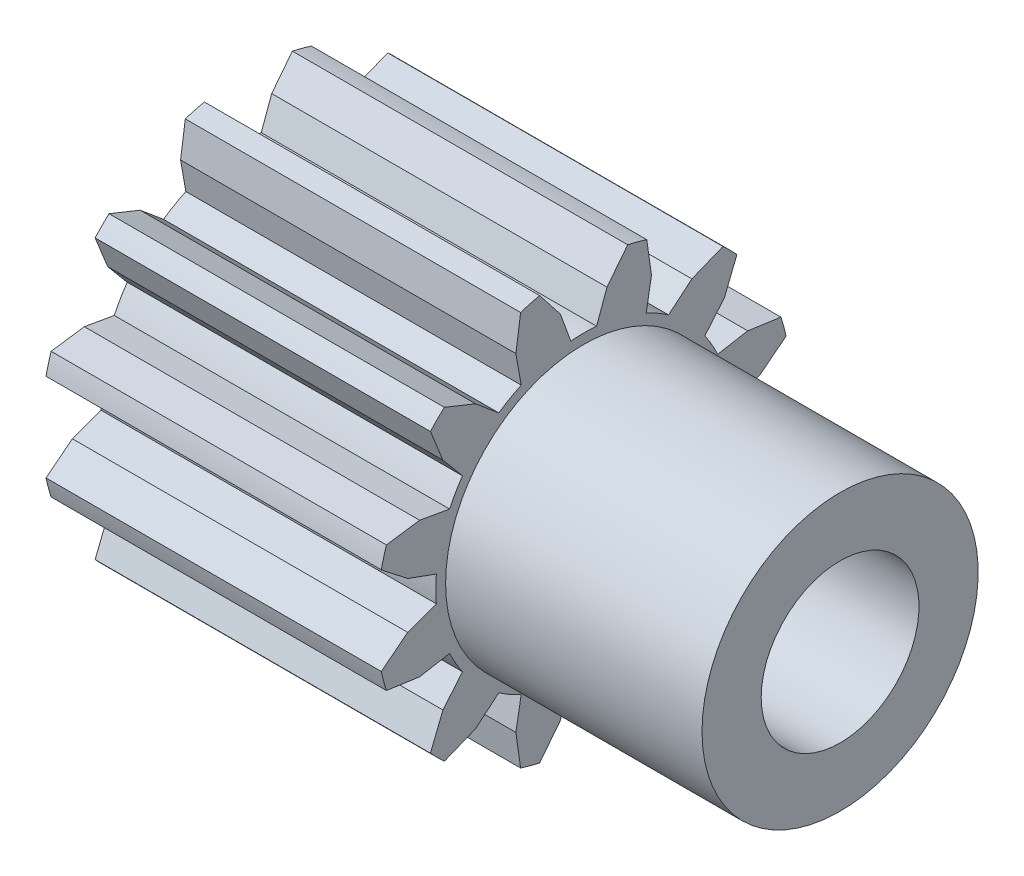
ISO-10303-21;
HEADER;
FILE_DESCRIPTION(('STEP AP214'),'2;1');
FILE_NAME('part.step','',(''),(''),'','','');
FILE_SCHEMA(('AUTOMOTIVE_DESIGN { 1 0 10303 214 1 1 1 1 }'));
ENDSEC;
DATA;
#1=APPLICATION_CONTEXT('core data for automotive mechanical design processes');
#2=APPLICATION_PROTOCOL_DEFINITION('international standard','automotive_design',2000,#1);
#3=PRODUCT_CONTEXT('',#1,'mechanical');
#4=PRODUCT('Part','Part','',(#3));
#5=PRODUCT_RELATED_PRODUCT_CATEGORY('part','',(#4));
#6=PRODUCT_DEFINITION_FORMATION('','',#4);
#7=PRODUCT_DEFINITION_CONTEXT('part definition',#1,'design');
#8=PRODUCT_DEFINITION('design','',#6,#7);
#9=PRODUCT_DEFINITION_SHAPE('','',#8);
#10=(LENGTH_UNIT() NAMED_UNIT(*) SI_UNIT(.MILLI.,.METRE.));
#11=(NAMED_UNIT(*) PLANE_ANGLE_UNIT() SI_UNIT($,.RADIAN.));
#12=(NAMED_UNIT(*) SI_UNIT($,.STERADIAN.) SOLID_ANGLE_UNIT());
#13=UNCERTAINTY_MEASURE_WITH_UNIT(LENGTH_MEASURE(1.E-05),#10,'distance_accuracy_value','');
#14=(GEOMETRIC_REPRESENTATION_CONTEXT(3) GLOBAL_UNCERTAINTY_ASSIGNED_CONTEXT((#13)) GLOBAL_UNIT_ASSIGNED_CONTEXT((#10,
#11,#12)) REPRESENTATION_CONTEXT('',''));
#15=CARTESIAN_POINT('',(0.,0.,0.));
#16=DIRECTION('',(0.,0.,1.));
#17=DIRECTION('',(1.,0.,0.));
#18=AXIS2_PLACEMENT_3D('',#15,#16,#17);
#19=CARTESIAN_POINT('',(8.5,2.23155413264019,-10.2601250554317));
#20=DIRECTION('',(0.,-0.786721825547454,-0.617307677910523));
#21=DIRECTION('',(0.,-0.617307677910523,0.786721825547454));
#22=AXIS2_PLACEMENT_3D('',#19,#20,#21);
#23=PLANE('',#22);
#24=DIRECTION('',(0.,-0.617307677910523,0.786721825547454));
#25=VECTOR('',#24,1.);
#26=CARTESIAN_POINT('',(8.5,1.70660416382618,-9.59110762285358));
#27=LINE('',#26,#25);
#28=CARTESIAN_POINT('',(8.5,2.23155413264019,-10.2601250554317));
#29=VERTEX_POINT('',#28);
#30=CARTESIAN_POINT('',(8.5,1.18165419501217,-8.92209019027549));
#31=VERTEX_POINT('',#30);
#32=EDGE_CURVE('E532',#29,#31,#27,.T.);
#33=ORIENTED_EDGE('',*,*,#32,.T.);
#34=DIRECTION('',(-1.,0.,0.));
#35=VECTOR('',#34,1.);
#36=CARTESIAN_POINT('',(8.5,1.18165419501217,-8.92209019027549));
#37=LINE('',#36,#35);
#38=CARTESIAN_POINT('',(-8.5,1.18165419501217,-8.92209019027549));
#39=VERTEX_POINT('',#38);
#40=EDGE_CURVE('E528',#39,#31,#37,.F.);
#41=ORIENTED_EDGE('',*,*,#40,.F.);
#42=DIRECTION('',(0.,0.617307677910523,-0.786721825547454));
#43=VECTOR('',#42,1.);
#44=CARTESIAN_POINT('',(-8.5,1.70660416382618,-9.59110762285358));
#45=LINE('',#44,#43);
#46=CARTESIAN_POINT('',(-8.5,2.23155413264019,-10.2601250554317));
#47=VERTEX_POINT('',#46);
#48=EDGE_CURVE('E540',#39,#47,#45,.T.);
#49=ORIENTED_EDGE('',*,*,#48,.T.);
#50=DIRECTION('',(-1.,0.,0.));
#51=VECTOR('',#50,1.);
#52=CARTESIAN_POINT('',(0.,2.23155413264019,-10.2601250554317));
#53=LINE('',#52,#51);
#54=EDGE_CURVE('E472',#29,#47,#53,.T.);
#55=ORIENTED_EDGE('',*,*,#54,.F.);
#56=EDGE_LOOP('',(#33,#41,#49,#55));
#57=FACE_BOUND('',#56,.T.);
#58=ADVANCED_FACE('F15',(#57),#23,.T.);
#59=CARTESIAN_POINT('',(8.5,1.18165419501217,-8.92209019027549));
#60=DIRECTION('',(0.,-0.93969262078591,-0.342020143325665));
#61=DIRECTION('',(0.,-0.342020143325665,0.93969262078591));
#62=AXIS2_PLACEMENT_3D('',#59,#60,#61);
#63=PLANE('',#62);
#64=DIRECTION('',(0.,-0.342020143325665,0.93969262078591));
#65=VECTOR('',#64,1.);
#66=CARTESIAN_POINT('',(8.5,0.9176611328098,-8.19677521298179));
#67=LINE('',#66,#65);
#68=CARTESIAN_POINT('',(8.5,0.653668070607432,-7.47146023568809));
#69=VERTEX_POINT('',#68);
#70=EDGE_CURVE('E523',#31,#69,#67,.T.);
#71=ORIENTED_EDGE('',*,*,#70,.T.);
#72=DIRECTION('',(1.,0.,0.));
#73=VECTOR('',#72,1.);
#74=CARTESIAN_POINT('',(0.,0.653668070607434,-7.47146023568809));
#75=LINE('',#74,#73);
#76=CARTESIAN_POINT('',(-8.5,0.653668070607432,-7.47146023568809));
#77=VERTEX_POINT('',#76);
#78=EDGE_CURVE('E471',#77,#69,#75,.T.);
#79=ORIENTED_EDGE('',*,*,#78,.F.);
#80=DIRECTION('',(0.,0.342020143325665,-0.93969262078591));
#81=VECTOR('',#80,1.);
#82=CARTESIAN_POINT('',(-8.5,0.9176611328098,-8.19677521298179));
#83=LINE('',#82,#81);
#84=EDGE_CURVE('E467',#77,#39,#83,.T.);
#85=ORIENTED_EDGE('',*,*,#84,.T.);
#86=ORIENTED_EDGE('',*,*,#40,.T.);
#87=EDGE_LOOP('',(#71,#79,#85,#86));
#88=FACE_BOUND('',#87,.T.);
#89=ADVANCED_FACE('F1725',(#88),#63,.T.);
#90=CARTESIAN_POINT('',(-8.5,2.40042360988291E-13,-5.60315682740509E-13));
#91=DIRECTION('',(-1.,0.,0.));
#92=DIRECTION('',(0.,0.,1.));
#93=AXIS2_PLACEMENT_3D('',#90,#91,#92);
#94=CYLINDRICAL_SURFACE('',#93,10.4999999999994);
#95=CARTESIAN_POINT('',(8.5,2.4E-13,-5.6E-13));
#96=DIRECTION('',(-1.,0.,0.));
#97=DIRECTION('',(0.,0.212528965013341,-0.97715476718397));
#98=AXIS2_PLACEMENT_3D('',#95,#96,#97);
#99=CIRCLE('',#98,10.4999999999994);
#100=CARTESIAN_POINT('',(8.5,3.19747995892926,-10.0013060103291));
#101=VERTEX_POINT('',#100);
#102=EDGE_CURVE('E515',#101,#29,#99,.T.);
#103=ORIENTED_EDGE('',*,*,#102,.T.);
#104=ORIENTED_EDGE('',*,*,#54,.T.);
#105=CARTESIAN_POINT('',(-8.5,2.4E-13,-5.6E-13));
#106=DIRECTION('',(-1.,0.,0.));
#107=DIRECTION('',(0.,0.212528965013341,-0.97715476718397));
#108=AXIS2_PLACEMENT_3D('',#105,#106,#107);
#109=CIRCLE('',#108,10.4999999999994);
#110=CARTESIAN_POINT('',(-8.5,3.19747995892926,-10.0013060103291));
#111=VERTEX_POINT('',#110);
#112=EDGE_CURVE('E518',#47,#111,#109,.F.);
#113=ORIENTED_EDGE('',*,*,#112,.T.);
#114=DIRECTION('',(-1.,0.,0.));
#115=VECTOR('',#114,1.);
#116=CARTESIAN_POINT('',(8.5,3.19747995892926,-10.0013060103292));
#117=LINE('',#116,#115);
#118=EDGE_CURVE('E486',#101,#111,#117,.T.);
#119=ORIENTED_EDGE('',*,*,#118,.F.);
#120=EDGE_LOOP('',(#103,#104,#113,#119));
#121=FACE_BOUND('',#120,.T.);
#122=ADVANCED_FACE('F1723',(#121),#94,.T.);
#123=CARTESIAN_POINT('',(-8.5,0.,2.80157841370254E-13));
#124=DIRECTION('',(-1.,0.,0.));
#125=DIRECTION('',(0.,0.,1.));
#126=AXIS2_PLACEMENT_3D('',#123,#124,#125);
#127=CYLINDRICAL_SURFACE('',#126,7.50000000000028);
#128=CARTESIAN_POINT('',(8.5,0.,2.80157841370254E-13));
#129=DIRECTION('',(-1.,0.,0.));
#130=DIRECTION('',(0.,0.,1.));
#131=AXIS2_PLACEMENT_3D('',#128,#129,#130);
#132=CIRCLE('',#131,7.50000000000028);
#133=CARTESIAN_POINT('',(8.5,-0.65366807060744,-7.47146023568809));
#134=VERTEX_POINT('',#133);
#135=EDGE_CURVE('E477',#69,#134,#132,.T.);
#136=ORIENTED_EDGE('',*,*,#135,.T.);
#137=DIRECTION('',(-1.,0.,0.));
#138=VECTOR('',#137,1.);
#139=CARTESIAN_POINT('',(8.5,-0.65366807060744,-7.47146023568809));
#140=LINE('',#139,#138);
#141=CARTESIAN_POINT('',(-8.5,-0.65366807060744,-7.47146023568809));
#142=VERTEX_POINT('',#141);
#143=EDGE_CURVE('E474',#142,#134,#140,.F.);
#144=ORIENTED_EDGE('',*,*,#143,.F.);
#145=CARTESIAN_POINT('',(-8.5,0.,2.80157841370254E-13));
#146=DIRECTION('',(-1.,0.,0.));
#147=DIRECTION('',(0.,0.,1.));
#148=AXIS2_PLACEMENT_3D('',#145,#146,#147);
#149=CIRCLE('',#148,7.50000000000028);
#150=EDGE_CURVE('E18',#142,#77,#149,.F.);
#151=ORIENTED_EDGE('',*,*,#150,.T.);
#152=ORIENTED_EDGE('',*,*,#78,.T.);
#153=EDGE_LOOP('',(#136,#144,#151,#152));
#154=FACE_BOUND('',#153,.T.);
#155=ADVANCED_FACE('F475',(#154),#127,.T.);
#156=CARTESIAN_POINT('',(8.5,3.43770254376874,-8.3175838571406));
#157=DIRECTION('',(0.,0.989974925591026,-0.141243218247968));
#158=DIRECTION('',(0.,-0.141243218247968,-0.989974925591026));
#159=AXIS2_PLACEMENT_3D('',#156,#157,#158);
#160=PLANE('',#159);
#161=DIRECTION('',(0.,-0.141243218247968,-0.989974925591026));
#162=VECTOR('',#161,1.);
#163=CARTESIAN_POINT('',(8.5,3.317591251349,-9.15944493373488));
#164=LINE('',#163,#162);
#165=CARTESIAN_POINT('',(8.5,3.43770254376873,-8.3175838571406));
#166=VERTEX_POINT('',#165);
#167=EDGE_CURVE('E489',#166,#101,#164,.T.);
#168=ORIENTED_EDGE('',*,*,#167,.T.);
#169=ORIENTED_EDGE('',*,*,#118,.T.);
#170=DIRECTION('',(0.,0.141243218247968,0.989974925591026));
#171=VECTOR('',#170,1.);
#172=CARTESIAN_POINT('',(-8.5,3.317591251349,-9.15944493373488));
#173=LINE('',#172,#171);
#174=CARTESIAN_POINT('',(-8.5,3.43770254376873,-8.3175838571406));
#175=VERTEX_POINT('',#174);
#176=EDGE_CURVE('E506',#111,#175,#173,.T.);
#177=ORIENTED_EDGE('',*,*,#176,.T.);
#178=DIRECTION('',(-1.,0.,0.));
#179=VECTOR('',#178,1.);
#180=CARTESIAN_POINT('',(8.5,3.43770254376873,-8.3175838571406));
#181=LINE('',#180,#179);
#182=EDGE_CURVE('E497',#166,#175,#181,.T.);
#183=ORIENTED_EDGE('',*,*,#182,.F.);
#184=EDGE_LOOP('',(#168,#169,#177,#183));
#185=FACE_BOUND('',#184,.T.);
#186=ADVANCED_FACE('F1717',(#185),#160,.T.);
#187=CARTESIAN_POINT('',(8.5,-0.65366807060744,-7.47146023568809));
#188=DIRECTION('',(0.,0.939692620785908,-0.34202014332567));
#189=DIRECTION('',(0.,-0.34202014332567,-0.939692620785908));
#190=AXIS2_PLACEMENT_3D('',#187,#188,#189);
#191=PLANE('',#190);
#192=DIRECTION('',(0.,-0.34202014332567,-0.939692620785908));
#193=VECTOR('',#192,1.);
#194=CARTESIAN_POINT('',(8.5,-0.917661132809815,-8.19677521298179));
#195=LINE('',#194,#193);
#196=CARTESIAN_POINT('',(8.5,-1.18165419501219,-8.92209019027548));
#197=VERTEX_POINT('',#196);
#198=EDGE_CURVE('E480',#134,#197,#195,.T.);
#199=ORIENTED_EDGE('',*,*,#198,.T.);
#200=DIRECTION('',(-1.,0.,0.));
#201=VECTOR('',#200,1.);
#202=CARTESIAN_POINT('',(8.5,-1.18165419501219,-8.92209019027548));
#203=LINE('',#202,#201);
#204=CARTESIAN_POINT('',(-8.5,-1.18165419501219,-8.92209019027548));
#205=VERTEX_POINT('',#204);
#206=EDGE_CURVE('E484',#205,#197,#203,.F.);
#207=ORIENTED_EDGE('',*,*,#206,.F.);
#208=DIRECTION('',(0.,0.34202014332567,0.939692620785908));
#209=VECTOR('',#208,1.);
#210=CARTESIAN_POINT('',(-8.5,-0.917661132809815,-8.19677521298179));
#211=LINE('',#210,#209);
#212=EDGE_CURVE('E464',#205,#142,#211,.T.);
#213=ORIENTED_EDGE('',*,*,#212,.T.);
#214=ORIENTED_EDGE('',*,*,#143,.T.);
#215=EDGE_LOOP('',(#199,#207,#213,#214));
#216=FACE_BOUND('',#215,.T.);
#217=ADVANCED_FACE('F482',(#216),#191,.T.);
#218=CARTESIAN_POINT('',(8.5,3.16963696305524,-6.79730840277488));
#219=DIRECTION('',(0.,0.984807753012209,0.173648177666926));
#220=DIRECTION('',(0.,0.173648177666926,-0.984807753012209));
#221=AXIS2_PLACEMENT_3D('',#218,#219,#220);
#222=PLANE('',#221);
#223=DIRECTION('',(0.,0.173648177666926,-0.984807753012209));
#224=VECTOR('',#223,1.);
#225=CARTESIAN_POINT('',(8.5,3.30366975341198,-7.55744612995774));
#226=LINE('',#225,#224);
#227=CARTESIAN_POINT('',(8.5,3.16963696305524,-6.79730840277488));
#228=VERTEX_POINT('',#227);
#229=EDGE_CURVE('E501',#228,#166,#226,.T.);
#230=ORIENTED_EDGE('',*,*,#229,.T.);
#231=ORIENTED_EDGE('',*,*,#182,.T.);
#232=DIRECTION('',(0.,-0.173648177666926,0.984807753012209));
#233=VECTOR('',#232,1.);
#234=CARTESIAN_POINT('',(-8.5,3.30366975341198,-7.55744612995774));
#235=LINE('',#234,#233);
#236=CARTESIAN_POINT('',(-8.5,3.16963696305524,-6.79730840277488));
#237=VERTEX_POINT('',#236);
#238=EDGE_CURVE('E675',#175,#237,#235,.T.);
#239=ORIENTED_EDGE('',*,*,#238,.T.);
#240=DIRECTION('',(-1.,0.,0.));
#241=VECTOR('',#240,1.);
#242=CARTESIAN_POINT('',(0.,3.16963696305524,-6.79730840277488));
#243=LINE('',#242,#241);
#244=EDGE_CURVE('E648',#228,#237,#243,.T.);
#245=ORIENTED_EDGE('',*,*,#244,.F.);
#246=EDGE_LOOP('',(#230,#231,#239,#245));
#247=FACE_BOUND('',#246,.T.);
#248=ADVANCED_FACE('F1711',(#247),#222,.T.);
#249=CARTESIAN_POINT('',(8.5,-1.18165419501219,-8.92209019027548));
#250=DIRECTION('',(0.,0.786721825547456,-0.61730767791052));
#251=DIRECTION('',(0.,-0.61730767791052,-0.786721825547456));
#252=AXIS2_PLACEMENT_3D('',#249,#250,#251);
#253=PLANE('',#252);
#254=DIRECTION('',(0.,-0.61730767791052,-0.786721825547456));
#255=VECTOR('',#254,1.);
#256=CARTESIAN_POINT('',(8.5,-1.7066041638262,-9.59110762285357));
#257=LINE('',#256,#255);
#258=CARTESIAN_POINT('',(8.5,-2.23155413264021,-10.2601250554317));
#259=VERTEX_POINT('',#258);
#260=EDGE_CURVE('E651',#197,#259,#257,.T.);
#261=ORIENTED_EDGE('',*,*,#260,.T.);
#262=DIRECTION('',(1.,0.,0.));
#263=VECTOR('',#262,1.);
#264=CARTESIAN_POINT('',(0.,-2.2315541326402,-10.2601250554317));
#265=LINE('',#264,#263);
#266=CARTESIAN_POINT('',(-8.5,-2.2315541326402,-10.2601250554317));
#267=VERTEX_POINT('',#266);
#268=EDGE_CURVE('E688',#267,#259,#265,.T.);
#269=ORIENTED_EDGE('',*,*,#268,.F.);
#270=DIRECTION('',(0.,0.61730767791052,0.786721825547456));
#271=VECTOR('',#270,1.);
#272=CARTESIAN_POINT('',(-8.5,-1.7066041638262,-9.59110762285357));
#273=LINE('',#272,#271);
#274=EDGE_CURVE('E500',#267,#205,#273,.T.);
#275=ORIENTED_EDGE('',*,*,#274,.T.);
#276=ORIENTED_EDGE('',*,*,#206,.T.);
#277=EDGE_LOOP('',(#261,#269,#275,#276));
#278=FACE_BOUND('',#277,.T.);
#279=ADVANCED_FACE('F687',(#278),#253,.T.);
#280=CARTESIAN_POINT('',(-8.5,0.,0.));
#281=DIRECTION('',(-1.,0.,0.));
#282=DIRECTION('',(0.,0.,1.));
#283=AXIS2_PLACEMENT_3D('',#280,#281,#282);
#284=CYLINDRICAL_SURFACE('',#283,7.5);
#285=CARTESIAN_POINT('',(8.5,0.,0.));
#286=DIRECTION('',(-1.,0.,0.));
#287=DIRECTION('',(0.,0.,1.));
#288=AXIS2_PLACEMENT_3D('',#285,#286,#287);
#289=CIRCLE('',#288,7.5);
#290=CARTESIAN_POINT('',(8.5,4.30182327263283,-6.14364033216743));
#291=VERTEX_POINT('',#290);
#292=EDGE_CURVE('E645',#291,#228,#289,.T.);
#293=ORIENTED_EDGE('',*,*,#292,.T.);
#294=ORIENTED_EDGE('',*,*,#244,.T.);
#295=CARTESIAN_POINT('',(-8.5,0.,0.));
#296=DIRECTION('',(-1.,0.,0.));
#297=DIRECTION('',(0.,0.,1.));
#298=AXIS2_PLACEMENT_3D('',#295,#296,#297);
#299=CIRCLE('',#298,7.5);
#300=CARTESIAN_POINT('',(-8.5,4.30182327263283,-6.14364033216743));
#301=VERTEX_POINT('',#300);
#302=EDGE_CURVE('E649',#237,#301,#299,.F.);
#303=ORIENTED_EDGE('',*,*,#302,.T.);
#304=DIRECTION('',(-1.,0.,0.));
#305=VECTOR('',#304,1.);
#306=CARTESIAN_POINT('',(8.5,4.30182327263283,-6.14364033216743));
#307=LINE('',#306,#305);
#308=EDGE_CURVE('E706',#291,#301,#307,.T.);
#309=ORIENTED_EDGE('',*,*,#308,.F.);
#310=EDGE_LOOP('',(#293,#294,#303,#309));
#311=FACE_BOUND('',#310,.T.);
#312=ADVANCED_FACE('F1706',(#311),#284,.T.);
#313=CARTESIAN_POINT('',(-8.5,0.,1.10154940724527E-13));
#314=DIRECTION('',(-1.,0.,0.));
#315=DIRECTION('',(0.,0.,1.));
#316=AXIS2_PLACEMENT_3D('',#313,#314,#315);
#317=CYLINDRICAL_SURFACE('',#316,10.5000000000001);
#318=CARTESIAN_POINT('',(8.5,0.,1.1E-13));
#319=DIRECTION('',(-1.,0.,0.));
#320=DIRECTION('',(0.,-0.304521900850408,-0.95250533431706));
#321=AXIS2_PLACEMENT_3D('',#318,#319,#320);
#322=CIRCLE('',#321,10.5000000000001);
#323=CARTESIAN_POINT('',(8.5,-3.19747995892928,-10.0013060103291));
#324=VERTEX_POINT('',#323);
#325=EDGE_CURVE('E685',#259,#324,#322,.T.);
#326=ORIENTED_EDGE('',*,*,#325,.T.);
#327=DIRECTION('',(-1.,0.,0.));
#328=VECTOR('',#327,1.);
#329=CARTESIAN_POINT('',(8.5,-3.19747995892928,-10.0013060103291));
#330=LINE('',#329,#328);
#331=CARTESIAN_POINT('',(-8.5,-3.19747995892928,-10.0013060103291));
#332=VERTEX_POINT('',#331);
#333=EDGE_CURVE('E697',#332,#324,#330,.F.);
#334=ORIENTED_EDGE('',*,*,#333,.F.);
#335=CARTESIAN_POINT('',(-8.5,0.,1.1E-13));
#336=DIRECTION('',(-1.,0.,0.));
#337=DIRECTION('',(0.,-0.304521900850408,-0.95250533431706));
#338=AXIS2_PLACEMENT_3D('',#335,#336,#337);
#339=CIRCLE('',#338,10.5000000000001);
#340=EDGE_CURVE('E672',#332,#267,#339,.F.);
#341=ORIENTED_EDGE('',*,*,#340,.T.);
#342=ORIENTED_EDGE('',*,*,#268,.T.);
#343=EDGE_LOOP('',(#326,#334,#341,#342));
#344=FACE_BOUND('',#343,.T.);
#345=ADVANCED_FACE('F698',(#344),#317,.T.);
#346=CARTESIAN_POINT('',(8.5,5.48438764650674,-7.13592966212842));
#347=DIRECTION('',(0.,-0.64278760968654,-0.766044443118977));
#348=DIRECTION('',(0.,-0.766044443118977,0.64278760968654));
#349=AXIS2_PLACEMENT_3D('',#346,#347,#348);
#350=PLANE('',#349);
#351=DIRECTION('',(0.,-0.766044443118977,0.64278760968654));
#352=VECTOR('',#351,1.);
#353=CARTESIAN_POINT('',(8.5,4.89310545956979,-6.63978499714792));
#354=LINE('',#353,#352);
#355=CARTESIAN_POINT('',(8.5,5.48438764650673,-7.13592966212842));
#356=VERTEX_POINT('',#355);
#357=EDGE_CURVE('E708',#356,#291,#354,.T.);
#358=ORIENTED_EDGE('',*,*,#357,.T.);
#359=ORIENTED_EDGE('',*,*,#308,.T.);
#360=DIRECTION('',(0.,0.766044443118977,-0.64278760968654));
#361=VECTOR('',#360,1.);
#362=CARTESIAN_POINT('',(-8.5,4.89310545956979,-6.63978499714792));
#363=LINE('',#362,#361);
#364=CARTESIAN_POINT('',(-8.5,5.48438764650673,-7.13592966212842));
#365=VERTEX_POINT('',#364);
#366=EDGE_CURVE('E725',#301,#365,#363,.T.);
#367=ORIENTED_EDGE('',*,*,#366,.T.);
#368=DIRECTION('',(-1.,0.,0.));
#369=VECTOR('',#368,1.);
#370=CARTESIAN_POINT('',(8.5,5.48438764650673,-7.13592966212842));
#371=LINE('',#370,#369);
#372=EDGE_CURVE('E716',#356,#365,#371,.T.);
#373=ORIENTED_EDGE('',*,*,#372,.F.);
#374=EDGE_LOOP('',(#358,#359,#367,#373));
#375=FACE_BOUND('',#374,.T.);
#376=ADVANCED_FACE('F740',(#375),#350,.T.);
#377=CARTESIAN_POINT('',(8.5,-3.19747995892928,-10.0013060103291));
#378=DIRECTION('',(0.,-0.989974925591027,-0.141243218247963));
#379=DIRECTION('',(0.,-0.141243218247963,0.989974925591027));
#380=AXIS2_PLACEMENT_3D('',#377,#378,#379);
#381=PLANE('',#380);
#382=DIRECTION('',(0.,-0.141243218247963,0.989974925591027));
#383=VECTOR('',#382,1.);
#384=CARTESIAN_POINT('',(8.5,-3.31759125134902,-9.15944493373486));
#385=LINE('',#384,#383);
#386=CARTESIAN_POINT('',(8.5,-3.43770254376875,-8.31758385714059));
#387=VERTEX_POINT('',#386);
#388=EDGE_CURVE('E700',#324,#387,#385,.T.);
#389=ORIENTED_EDGE('',*,*,#388,.T.);
#390=DIRECTION('',(-1.,0.,0.));
#391=VECTOR('',#390,1.);
#392=CARTESIAN_POINT('',(8.5,-3.43770254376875,-8.31758385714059));
#393=LINE('',#392,#391);
#394=CARTESIAN_POINT('',(-8.5,-3.43770254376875,-8.31758385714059));
#395=VERTEX_POINT('',#394);
#396=EDGE_CURVE('E704',#395,#387,#393,.F.);
#397=ORIENTED_EDGE('',*,*,#396,.F.);
#398=DIRECTION('',(0.,0.141243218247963,-0.989974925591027));
#399=VECTOR('',#398,1.);
#400=CARTESIAN_POINT('',(-8.5,-3.31759125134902,-9.15944493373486));
#401=LINE('',#400,#399);
#402=EDGE_CURVE('E692',#395,#332,#401,.T.);
#403=ORIENTED_EDGE('',*,*,#402,.T.);
#404=ORIENTED_EDGE('',*,*,#333,.T.);
#405=EDGE_LOOP('',(#389,#397,#403,#404));
#406=FACE_BOUND('',#405,.T.);
#407=ADVANCED_FACE('F702',(#406),#381,.T.);
#408=CARTESIAN_POINT('',(8.5,7.06264509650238,-7.76975187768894));
#409=DIRECTION('',(0.,-0.372667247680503,-0.927965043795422));
#410=DIRECTION('',(0.,-0.927965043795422,0.372667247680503));
#411=AXIS2_PLACEMENT_3D('',#408,#409,#410);
#412=PLANE('',#411);
#413=DIRECTION('',(0.,-0.927965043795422,0.372667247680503));
#414=VECTOR('',#413,1.);
#415=CARTESIAN_POINT('',(8.5,6.27351637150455,-7.45284076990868));
#416=LINE('',#415,#414);
#417=CARTESIAN_POINT('',(8.5,7.06264509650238,-7.76975187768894));
#418=VERTEX_POINT('',#417);
#419=EDGE_CURVE('E720',#418,#356,#416,.T.);
#420=ORIENTED_EDGE('',*,*,#419,.T.);
#421=ORIENTED_EDGE('',*,*,#372,.T.);
#422=DIRECTION('',(0.,0.927965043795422,-0.372667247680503));
#423=VECTOR('',#422,1.);
#424=CARTESIAN_POINT('',(-8.5,6.27351637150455,-7.45284076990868));
#425=LINE('',#424,#423);
#426=CARTESIAN_POINT('',(-8.5,7.06264509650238,-7.76975187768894));
#427=VERTEX_POINT('',#426);
#428=EDGE_CURVE('E746',#365,#427,#425,.T.);
#429=ORIENTED_EDGE('',*,*,#428,.T.);
#430=DIRECTION('',(-1.,0.,0.));
#431=VECTOR('',#430,1.);
#432=CARTESIAN_POINT('',(0.,7.06264509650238,-7.76975187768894));
#433=LINE('',#432,#431);
#434=EDGE_CURVE('E644',#418,#427,#433,.T.);
#435=ORIENTED_EDGE('',*,*,#434,.F.);
#436=EDGE_LOOP('',(#420,#421,#429,#435));
#437=FACE_BOUND('',#436,.T.);
#438=ADVANCED_FACE('F744',(#437),#412,.T.);
#439=CARTESIAN_POINT('',(8.5,-3.43770254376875,-8.31758385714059));
#440=DIRECTION('',(0.,-0.984807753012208,0.173648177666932));
#441=DIRECTION('',(0.,0.173648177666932,0.984807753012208));
#442=AXIS2_PLACEMENT_3D('',#439,#440,#441);
#443=PLANE('',#442);
#444=DIRECTION('',(0.,0.173648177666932,0.984807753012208));
#445=VECTOR('',#444,1.);
#446=CARTESIAN_POINT('',(8.5,-3.303669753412,-7.55744612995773));
#447=LINE('',#446,#445);
#448=CARTESIAN_POINT('',(8.5,-3.16963696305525,-6.79730840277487));
#449=VERTEX_POINT('',#448);
#450=EDGE_CURVE('E760',#387,#449,#447,.T.);
#451=ORIENTED_EDGE('',*,*,#450,.T.);
#452=DIRECTION('',(1.,0.,0.));
#453=VECTOR('',#452,1.);
#454=CARTESIAN_POINT('',(0.,-3.16963696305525,-6.79730840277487));
#455=LINE('',#454,#453);
#456=CARTESIAN_POINT('',(-8.5,-3.16963696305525,-6.79730840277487));
#457=VERTEX_POINT('',#456);
#458=EDGE_CURVE('E640',#457,#449,#455,.T.);
#459=ORIENTED_EDGE('',*,*,#458,.F.);
#460=DIRECTION('',(0.,-0.173648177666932,-0.984807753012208));
#461=VECTOR('',#460,1.);
#462=CARTESIAN_POINT('',(-8.5,-3.303669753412,-7.55744612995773));
#463=LINE('',#462,#461);
#464=EDGE_CURVE('E719',#457,#395,#463,.T.);
#465=ORIENTED_EDGE('',*,*,#464,.T.);
#466=ORIENTED_EDGE('',*,*,#396,.T.);
#467=EDGE_LOOP('',(#451,#459,#465,#466));
#468=FACE_BOUND('',#467,.T.);
#469=ADVANCED_FACE('F770',(#468),#443,.T.);
#470=CARTESIAN_POINT('',(-8.5,-8.89913143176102E-13,7.09935582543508E-13));
#471=DIRECTION('',(-1.,0.,0.));
#472=DIRECTION('',(0.,0.,1.));
#473=AXIS2_PLACEMENT_3D('',#470,#471,#472);
#474=CYLINDRICAL_SURFACE('',#473,10.5000000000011);
#475=CARTESIAN_POINT('',(8.5,-8.90000000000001E-13,7.1E-13));
#476=DIRECTION('',(-1.,0.,0.));
#477=DIRECTION('',(0.,0.672632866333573,-0.739976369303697));
#478=AXIS2_PLACEMENT_3D('',#475,#476,#477);
#479=CIRCLE('',#478,10.5000000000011);
#480=CARTESIAN_POINT('',(8.5,7.76975187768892,-7.06264509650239));
#481=VERTEX_POINT('',#480);
#482=EDGE_CURVE('E776',#481,#418,#479,.T.);
#483=ORIENTED_EDGE('',*,*,#482,.T.);
#484=ORIENTED_EDGE('',*,*,#434,.T.);
#485=CARTESIAN_POINT('',(-8.5,-8.90000000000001E-13,7.1E-13));
#486=DIRECTION('',(-1.,0.,0.));
#487=DIRECTION('',(0.,0.672632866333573,-0.739976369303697));
#488=AXIS2_PLACEMENT_3D('',#485,#486,#487);
#489=CIRCLE('',#488,10.5000000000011);
#490=CARTESIAN_POINT('',(-8.5,7.76975187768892,-7.06264509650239));
#491=VERTEX_POINT('',#490);
#492=EDGE_CURVE('E768',#427,#491,#489,.F.);
#493=ORIENTED_EDGE('',*,*,#492,.T.);
#494=DIRECTION('',(-1.,0.,0.));
#495=VECTOR('',#494,1.);
#496=CARTESIAN_POINT('',(8.5,7.76975187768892,-7.06264509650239));
#497=LINE('',#496,#495);
#498=EDGE_CURVE('E802',#481,#491,#497,.T.);
#499=ORIENTED_EDGE('',*,*,#498,.F.);
#500=EDGE_LOOP('',(#483,#484,#493,#499));
#501=FACE_BOUND('',#500,.T.);
#502=ADVANCED_FACE('F860',(#501),#474,.T.);
#503=CARTESIAN_POINT('',(-8.5,-1.40078920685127E-13,-2.29850860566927E-13));
#504=DIRECTION('',(-1.,0.,0.));
#505=DIRECTION('',(0.,0.,1.));
#506=AXIS2_PLACEMENT_3D('',#503,#504,#505);
#507=CYLINDRICAL_SURFACE('',#506,7.49999999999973);
#508=CARTESIAN_POINT('',(8.5,-1.40078920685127E-13,-2.29850860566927E-13));
#509=DIRECTION('',(-1.,0.,0.));
#510=DIRECTION('',(0.,0.,1.));
#511=AXIS2_PLACEMENT_3D('',#508,#509,#510);
#512=CIRCLE('',#511,7.49999999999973);
#513=CARTESIAN_POINT('',(8.5,-4.30182327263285,-6.14364033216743));
#514=VERTEX_POINT('',#513);
#515=EDGE_CURVE('E637',#449,#514,#512,.T.);
#516=ORIENTED_EDGE('',*,*,#515,.T.);
#517=DIRECTION('',(-1.,0.,0.));
#518=VECTOR('',#517,1.);
#519=CARTESIAN_POINT('',(8.5,-4.30182327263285,-6.14364033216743));
#520=LINE('',#519,#518);
#521=CARTESIAN_POINT('',(-8.5,-4.30182327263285,-6.14364033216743));
#522=VERTEX_POINT('',#521);
#523=EDGE_CURVE('E794',#522,#514,#520,.F.);
#524=ORIENTED_EDGE('',*,*,#523,.F.);
#525=CARTESIAN_POINT('',(-8.5,-1.40078920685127E-13,-2.29850860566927E-13));
#526=DIRECTION('',(-1.,0.,0.));
#527=DIRECTION('',(0.,0.,1.));
#528=AXIS2_PLACEMENT_3D('',#525,#526,#527);
#529=CIRCLE('',#528,7.49999999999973);
#530=EDGE_CURVE('E641',#522,#457,#529,.F.);
#531=ORIENTED_EDGE('',*,*,#530,.T.);
#532=ORIENTED_EDGE('',*,*,#458,.T.);
#533=EDGE_LOOP('',(#516,#524,#531,#532));
#534=FACE_BOUND('',#533,.T.);
#535=ADVANCED_FACE('F791',(#534),#507,.T.);
#536=CARTESIAN_POINT('',(8.5,7.13592966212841,-5.48438764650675));
#537=DIRECTION('',(0.,0.927965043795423,0.3726672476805));
#538=DIRECTION('',(0.,0.3726672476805,-0.927965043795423));
#539=AXIS2_PLACEMENT_3D('',#536,#537,#538);
#540=PLANE('',#539);
#541=DIRECTION('',(0.,0.3726672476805,-0.927965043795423));
#542=VECTOR('',#541,1.);
#543=CARTESIAN_POINT('',(8.5,7.45284076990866,-6.27351637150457));
#544=LINE('',#543,#542);
#545=CARTESIAN_POINT('',(8.5,7.13592966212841,-5.48438764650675));
#546=VERTEX_POINT('',#545);
#547=EDGE_CURVE('E847',#546,#481,#544,.T.);
#548=ORIENTED_EDGE('',*,*,#547,.T.);
#549=ORIENTED_EDGE('',*,*,#498,.T.);
#550=DIRECTION('',(0.,-0.3726672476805,0.927965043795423));
#551=VECTOR('',#550,1.);
#552=CARTESIAN_POINT('',(-8.5,7.45284076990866,-6.27351637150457));
#553=LINE('',#552,#551);
#554=CARTESIAN_POINT('',(-8.5,7.13592966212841,-5.48438764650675));
#555=VERTEX_POINT('',#554);
#556=EDGE_CURVE('E639',#491,#555,#553,.T.);
#557=ORIENTED_EDGE('',*,*,#556,.T.);
#558=DIRECTION('',(-1.,0.,0.));
#559=VECTOR('',#558,1.);
#560=CARTESIAN_POINT('',(8.5,7.13592966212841,-5.48438764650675));
#561=LINE('',#560,#559);
#562=EDGE_CURVE('E815',#546,#555,#561,.T.);
#563=ORIENTED_EDGE('',*,*,#562,.F.);
#564=EDGE_LOOP('',(#548,#549,#557,#563));
#565=FACE_BOUND('',#564,.T.);
#566=ADVANCED_FACE('F858',(#565),#540,.T.);
#567=CARTESIAN_POINT('',(8.5,-4.30182327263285,-6.14364033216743));
#568=DIRECTION('',(0.,0.642787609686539,-0.766044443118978));
#569=DIRECTION('',(0.,-0.766044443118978,-0.642787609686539));
#570=AXIS2_PLACEMENT_3D('',#567,#568,#569);
#571=PLANE('',#570);
#572=DIRECTION('',(0.,-0.766044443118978,-0.642787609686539));
#573=VECTOR('',#572,1.);
#574=CARTESIAN_POINT('',(8.5,-4.8931054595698,-6.63978499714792));
#575=LINE('',#574,#573);
#576=CARTESIAN_POINT('',(8.5,-5.48438764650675,-7.13592966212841));
#577=VERTEX_POINT('',#576);
#578=EDGE_CURVE('E807',#514,#577,#575,.T.);
#579=ORIENTED_EDGE('',*,*,#578,.T.);
#580=DIRECTION('',(-1.,0.,0.));
#581=VECTOR('',#580,1.);
#582=CARTESIAN_POINT('',(8.5,-5.48438764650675,-7.13592966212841));
#583=LINE('',#582,#581);
#584=CARTESIAN_POINT('',(-8.5,-5.48438764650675,-7.13592966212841));
#585=VERTEX_POINT('',#584);
#586=EDGE_CURVE('E805',#585,#577,#583,.F.);
#587=ORIENTED_EDGE('',*,*,#586,.F.);
#588=DIRECTION('',(0.,0.766044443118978,0.642787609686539));
#589=VECTOR('',#588,1.);
#590=CARTESIAN_POINT('',(-8.5,-4.8931054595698,-6.63978499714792));
#591=LINE('',#590,#589);
#592=EDGE_CURVE('E796',#585,#522,#591,.T.);
#593=ORIENTED_EDGE('',*,*,#592,.T.);
#594=ORIENTED_EDGE('',*,*,#523,.T.);
#595=EDGE_LOOP('',(#579,#587,#593,#594));
#596=FACE_BOUND('',#595,.T.);
#597=ADVANCED_FACE('F806',(#596),#571,.T.);
#598=CARTESIAN_POINT('',(8.5,6.14364033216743,-4.30182327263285));
#599=DIRECTION('',(0.,0.766044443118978,0.642787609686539));
#600=DIRECTION('',(0.,0.642787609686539,-0.766044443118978));
#601=AXIS2_PLACEMENT_3D('',#598,#599,#600);
#602=PLANE('',#601);
#603=DIRECTION('',(0.,0.642787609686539,-0.766044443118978));
#604=VECTOR('',#603,1.);
#605=CARTESIAN_POINT('',(8.5,6.63978499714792,-4.8931054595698));
#606=LINE('',#605,#604);
#607=CARTESIAN_POINT('',(8.5,6.14364033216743,-4.30182327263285));
#608=VERTEX_POINT('',#607);
#609=EDGE_CURVE('E818',#608,#546,#606,.T.);
#610=ORIENTED_EDGE('',*,*,#609,.T.);
#611=ORIENTED_EDGE('',*,*,#562,.T.);
#612=DIRECTION('',(0.,-0.642787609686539,0.766044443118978));
#613=VECTOR('',#612,1.);
#614=CARTESIAN_POINT('',(-8.5,6.63978499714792,-4.8931054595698));
#615=LINE('',#614,#613);
#616=CARTESIAN_POINT('',(-8.5,6.14364033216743,-4.30182327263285));
#617=VERTEX_POINT('',#616);
#618=EDGE_CURVE('E831',#555,#617,#615,.T.);
#619=ORIENTED_EDGE('',*,*,#618,.T.);
#620=DIRECTION('',(-1.,0.,0.));
#621=VECTOR('',#620,1.);
#622=CARTESIAN_POINT('',(0.,6.14364033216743,-4.30182327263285));
#623=LINE('',#622,#621);
#624=EDGE_CURVE('E632',#608,#617,#623,.T.);
#625=ORIENTED_EDGE('',*,*,#624,.F.);
#626=EDGE_LOOP('',(#610,#611,#619,#625));
#627=FACE_BOUND('',#626,.T.);
#628=ADVANCED_FACE('F863',(#627),#602,.T.);
#629=CARTESIAN_POINT('',(8.5,-5.48438764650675,-7.13592966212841));
#630=DIRECTION('',(0.,0.372667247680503,-0.927965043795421));
#631=DIRECTION('',(0.,-0.927965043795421,-0.372667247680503));
#632=AXIS2_PLACEMENT_3D('',#629,#630,#631);
#633=PLANE('',#632);
#634=DIRECTION('',(0.,-0.927965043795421,-0.372667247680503));
#635=VECTOR('',#634,1.);
#636=CARTESIAN_POINT('',(8.5,-6.27351637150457,-7.45284076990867));
#637=LINE('',#636,#635);
#638=CARTESIAN_POINT('',(8.5,-7.0626450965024,-7.76975187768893));
#639=VERTEX_POINT('',#638);
#640=EDGE_CURVE('E636',#577,#639,#637,.T.);
#641=ORIENTED_EDGE('',*,*,#640,.T.);
#642=DIRECTION('',(1.,0.,0.));
#643=VECTOR('',#642,1.);
#644=CARTESIAN_POINT('',(0.,-7.0626450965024,-7.76975187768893));
#645=LINE('',#644,#643);
#646=CARTESIAN_POINT('',(-8.5,-7.0626450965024,-7.76975187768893));
#647=VERTEX_POINT('',#646);
#648=EDGE_CURVE('E813',#647,#639,#645,.T.);
#649=ORIENTED_EDGE('',*,*,#648,.F.);
#650=DIRECTION('',(0.,0.927965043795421,0.372667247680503));
#651=VECTOR('',#650,1.);
#652=CARTESIAN_POINT('',(-8.5,-6.27351637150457,-7.45284076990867));
#653=LINE('',#652,#651);
#654=EDGE_CURVE('E799',#647,#585,#653,.T.);
#655=ORIENTED_EDGE('',*,*,#654,.T.);
#656=ORIENTED_EDGE('',*,*,#586,.T.);
#657=EDGE_LOOP('',(#641,#649,#655,#656));
#658=FACE_BOUND('',#657,.T.);
#659=ADVANCED_FACE('F811',(#658),#633,.T.);
#660=CARTESIAN_POINT('',(-8.5,4.50160742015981E-13,-2.4980018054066E-13));
#661=DIRECTION('',(-1.,0.,0.));
#662=DIRECTION('',(0.,0.,1.));
#663=AXIS2_PLACEMENT_3D('',#660,#661,#662);
#664=CYLINDRICAL_SURFACE('',#663,7.49999999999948);
#665=CARTESIAN_POINT('',(8.5,4.50160742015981E-13,-2.4980018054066E-13));
#666=DIRECTION('',(-1.,0.,0.));
#667=DIRECTION('',(0.,0.,1.));
#668=AXIS2_PLACEMENT_3D('',#665,#666,#667);
#669=CIRCLE('',#668,7.49999999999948);
#670=CARTESIAN_POINT('',(8.5,6.79730840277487,-3.16963696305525));
#671=VERTEX_POINT('',#670);
#672=EDGE_CURVE('E629',#671,#608,#669,.T.);
#673=ORIENTED_EDGE('',*,*,#672,.T.);
#674=ORIENTED_EDGE('',*,*,#624,.T.);
#675=CARTESIAN_POINT('',(-8.5,4.50160742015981E-13,-2.4980018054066E-13));
#676=DIRECTION('',(-1.,0.,0.));
#677=DIRECTION('',(0.,0.,1.));
#678=AXIS2_PLACEMENT_3D('',#675,#676,#677);
#679=CIRCLE('',#678,7.49999999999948);
#680=CARTESIAN_POINT('',(-8.5,6.79730840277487,-3.16963696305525));
#681=VERTEX_POINT('',#680);
#682=EDGE_CURVE('E633',#617,#681,#679,.F.);
#683=ORIENTED_EDGE('',*,*,#682,.T.);
#684=DIRECTION('',(-1.,0.,0.));
#685=VECTOR('',#684,1.);
#686=CARTESIAN_POINT('',(8.5,6.79730840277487,-3.16963696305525));
#687=LINE('',#686,#685);
#688=EDGE_CURVE('E868',#671,#681,#687,.T.);
#689=ORIENTED_EDGE('',*,*,#688,.F.);
#690=EDGE_LOOP('',(#673,#674,#683,#689));
#691=FACE_BOUND('',#690,.T.);
#692=ADVANCED_FACE('F865',(#691),#664,.T.);
#693=CARTESIAN_POINT('',(-8.5,1.51007678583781E-12,1.49012746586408E-12));
#694=DIRECTION('',(-1.,0.,0.));
#695=DIRECTION('',(0.,0.,1.));
#696=AXIS2_PLACEMENT_3D('',#693,#694,#695);
#697=CYLINDRICAL_SURFACE('',#696,10.5000000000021);
#698=CARTESIAN_POINT('',(8.5,1.51E-12,1.49E-12));
#699=DIRECTION('',(-1.,0.,0.));
#700=DIRECTION('',(0.,-0.739976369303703,-0.672632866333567));
#701=AXIS2_PLACEMENT_3D('',#698,#699,#700);
#702=CIRCLE('',#701,10.5000000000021);
#703=CARTESIAN_POINT('',(8.5,-7.76975187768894,-7.06264509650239));
#704=VERTEX_POINT('',#703);
#705=EDGE_CURVE('E921',#639,#704,#702,.T.);
#706=ORIENTED_EDGE('',*,*,#705,.T.);
#707=DIRECTION('',(-1.,0.,0.));
#708=VECTOR('',#707,1.);
#709=CARTESIAN_POINT('',(8.5,-7.76975187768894,-7.06264509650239));
#710=LINE('',#709,#708);
#711=CARTESIAN_POINT('',(-8.5,-7.76975187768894,-7.06264509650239));
#712=VERTEX_POINT('',#711);
#713=EDGE_CURVE('E908',#712,#704,#710,.F.);
#714=ORIENTED_EDGE('',*,*,#713,.F.);
#715=CARTESIAN_POINT('',(-8.5,1.51E-12,1.49E-12));
#716=DIRECTION('',(-1.,0.,0.));
#717=DIRECTION('',(0.,-0.739976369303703,-0.672632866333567));
#718=AXIS2_PLACEMENT_3D('',#715,#716,#717);
#719=CIRCLE('',#718,10.5000000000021);
#720=EDGE_CURVE('E828',#712,#647,#719,.F.);
#721=ORIENTED_EDGE('',*,*,#720,.T.);
#722=ORIENTED_EDGE('',*,*,#648,.T.);
#723=EDGE_LOOP('',(#706,#714,#721,#722));
#724=FACE_BOUND('',#723,.T.);
#725=ADVANCED_FACE('F942',(#724),#697,.T.);
#726=CARTESIAN_POINT('',(8.5,8.31758385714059,-3.43770254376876));
#727=DIRECTION('',(0.,-0.173648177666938,-0.984807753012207));
#728=DIRECTION('',(0.,-0.984807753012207,0.173648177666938));
#729=AXIS2_PLACEMENT_3D('',#726,#727,#728);
#730=PLANE('',#729);
#731=DIRECTION('',(0.,-0.984807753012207,0.173648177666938));
#732=VECTOR('',#731,1.);
#733=CARTESIAN_POINT('',(8.5,7.55744612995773,-3.303669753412));
#734=LINE('',#733,#732);
#735=CARTESIAN_POINT('',(8.5,8.31758385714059,-3.43770254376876));
#736=VERTEX_POINT('',#735);
#737=EDGE_CURVE('E870',#736,#671,#734,.T.);
#738=ORIENTED_EDGE('',*,*,#737,.T.);
#739=ORIENTED_EDGE('',*,*,#688,.T.);
#740=DIRECTION('',(0.,0.984807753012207,-0.173648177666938));
#741=VECTOR('',#740,1.);
#742=CARTESIAN_POINT('',(-8.5,7.55744612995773,-3.303669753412));
#743=LINE('',#742,#741);
#744=CARTESIAN_POINT('',(-8.5,8.31758385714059,-3.43770254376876));
#745=VERTEX_POINT('',#744);
#746=EDGE_CURVE('E876',#681,#745,#743,.T.);
#747=ORIENTED_EDGE('',*,*,#746,.T.);
#748=DIRECTION('',(-1.,0.,0.));
#749=VECTOR('',#748,1.);
#750=CARTESIAN_POINT('',(8.5,8.31758385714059,-3.43770254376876));
#751=LINE('',#750,#749);
#752=EDGE_CURVE('E880',#736,#745,#751,.T.);
#753=ORIENTED_EDGE('',*,*,#752,.F.);
#754=EDGE_LOOP('',(#738,#739,#747,#753));
#755=FACE_BOUND('',#754,.T.);
#756=ADVANCED_FACE('F881',(#755),#730,.T.);
#757=CARTESIAN_POINT('',(8.5,-7.76975187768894,-7.06264509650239));
#758=DIRECTION('',(0.,-0.927965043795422,0.372667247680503));
#759=DIRECTION('',(0.,0.372667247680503,0.927965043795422));
#760=AXIS2_PLACEMENT_3D('',#757,#758,#759);
#761=PLANE('',#760);
#762=DIRECTION('',(0.,0.372667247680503,0.927965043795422));
#763=VECTOR('',#762,1.);
#764=CARTESIAN_POINT('',(8.5,-7.45284076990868,-6.27351637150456));
#765=LINE('',#764,#763);
#766=CARTESIAN_POINT('',(8.5,-7.13592966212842,-5.48438764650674));
#767=VERTEX_POINT('',#766);
#768=EDGE_CURVE('E891',#704,#767,#765,.T.);
#769=ORIENTED_EDGE('',*,*,#768,.T.);
#770=DIRECTION('',(-1.,0.,0.));
#771=VECTOR('',#770,1.);
#772=CARTESIAN_POINT('',(8.5,-7.13592966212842,-5.48438764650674));
#773=LINE('',#772,#771);
#774=CARTESIAN_POINT('',(-8.5,-7.13592966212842,-5.48438764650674));
#775=VERTEX_POINT('',#774);
#776=EDGE_CURVE('E901',#775,#767,#773,.F.);
#777=ORIENTED_EDGE('',*,*,#776,.F.);
#778=DIRECTION('',(0.,-0.372667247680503,-0.927965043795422));
#779=VECTOR('',#778,1.);
#780=CARTESIAN_POINT('',(-8.5,-7.45284076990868,-6.27351637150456));
#781=LINE('',#780,#779);
#782=EDGE_CURVE('E911',#775,#712,#781,.T.);
#783=ORIENTED_EDGE('',*,*,#782,.T.);
#784=ORIENTED_EDGE('',*,*,#713,.T.);
#785=EDGE_LOOP('',(#769,#777,#783,#784));
#786=FACE_BOUND('',#785,.T.);
#787=ADVANCED_FACE('F947',(#786),#761,.T.);
#788=CARTESIAN_POINT('',(8.5,10.0013060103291,-3.19747995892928));
#789=DIRECTION('',(0.,0.141243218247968,-0.989974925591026));
#790=DIRECTION('',(0.,-0.989974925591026,-0.141243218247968));
#791=AXIS2_PLACEMENT_3D('',#788,#789,#790);
#792=PLANE('',#791);
#793=DIRECTION('',(0.,-0.989974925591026,-0.141243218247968));
#794=VECTOR('',#793,1.);
#795=CARTESIAN_POINT('',(8.5,9.15944493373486,-3.31759125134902));
#796=LINE('',#795,#794);
#797=CARTESIAN_POINT('',(8.5,10.0013060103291,-3.19747995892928));
#798=VERTEX_POINT('',#797);
#799=EDGE_CURVE('E873',#798,#736,#796,.T.);
#800=ORIENTED_EDGE('',*,*,#799,.T.);
#801=ORIENTED_EDGE('',*,*,#752,.T.);
#802=DIRECTION('',(0.,0.989974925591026,0.141243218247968));
#803=VECTOR('',#802,1.);
#804=CARTESIAN_POINT('',(-8.5,9.15944493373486,-3.31759125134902));
#805=LINE('',#804,#803);
#806=CARTESIAN_POINT('',(-8.5,10.0013060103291,-3.19747995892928));
#807=VERTEX_POINT('',#806);
#808=EDGE_CURVE('E889',#745,#807,#805,.T.);
#809=ORIENTED_EDGE('',*,*,#808,.T.);
#810=DIRECTION('',(-1.,0.,0.));
#811=VECTOR('',#810,1.);
#812=CARTESIAN_POINT('',(0.,10.0013060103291,-3.19747995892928));
#813=LINE('',#812,#811);
#814=EDGE_CURVE('E628',#798,#807,#813,.T.);
#815=ORIENTED_EDGE('',*,*,#814,.F.);
#816=EDGE_LOOP('',(#800,#801,#809,#815));
#817=FACE_BOUND('',#816,.T.);
#818=ADVANCED_FACE('F886',(#817),#792,.T.);
#819=CARTESIAN_POINT('',(8.5,-7.13592966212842,-5.48438764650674));
#820=DIRECTION('',(0.,-0.766044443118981,0.642787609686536));
#821=DIRECTION('',(0.,0.642787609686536,0.766044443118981));
#822=AXIS2_PLACEMENT_3D('',#819,#820,#821);
#823=PLANE('',#822);
#824=DIRECTION('',(0.,0.642787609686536,0.766044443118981));
#825=VECTOR('',#824,1.);
#826=CARTESIAN_POINT('',(8.5,-6.63978499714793,-4.89310545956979));
#827=LINE('',#826,#825);
#828=CARTESIAN_POINT('',(8.5,-6.14364033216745,-4.30182327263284));
#829=VERTEX_POINT('',#828);
#830=EDGE_CURVE('E904',#767,#829,#827,.T.);
#831=ORIENTED_EDGE('',*,*,#830,.T.);
#832=DIRECTION('',(1.,0.,0.));
#833=VECTOR('',#832,1.);
#834=CARTESIAN_POINT('',(0.,-6.14364033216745,-4.30182327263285));
#835=LINE('',#834,#833);
#836=CARTESIAN_POINT('',(-8.5,-6.14364033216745,-4.30182327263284));
#837=VERTEX_POINT('',#836);
#838=EDGE_CURVE('E624',#837,#829,#835,.T.);
#839=ORIENTED_EDGE('',*,*,#838,.F.);
#840=DIRECTION('',(0.,-0.642787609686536,-0.766044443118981));
#841=VECTOR('',#840,1.);
#842=CARTESIAN_POINT('',(-8.5,-6.63978499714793,-4.89310545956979));
#843=LINE('',#842,#841);
#844=EDGE_CURVE('E884',#837,#775,#843,.T.);
#845=ORIENTED_EDGE('',*,*,#844,.T.);
#846=ORIENTED_EDGE('',*,*,#776,.T.);
#847=EDGE_LOOP('',(#831,#839,#845,#846));
#848=FACE_BOUND('',#847,.T.);
#849=ADVANCED_FACE('F949',(#848),#823,.T.);
#850=CARTESIAN_POINT('',(-8.5,0.,0.));
#851=DIRECTION('',(-1.,0.,0.));
#852=DIRECTION('',(0.,0.,1.));
#853=AXIS2_PLACEMENT_3D('',#850,#851,#852);
#854=CYLINDRICAL_SURFACE('',#853,10.5);
#855=CARTESIAN_POINT('',(8.5,0.,0.));
#856=DIRECTION('',(-1.,0.,0.));
#857=DIRECTION('',(0.,0.952505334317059,-0.30452190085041));
#858=AXIS2_PLACEMENT_3D('',#855,#856,#857);
#859=CIRCLE('',#858,10.5);
#860=CARTESIAN_POINT('',(8.5,10.2601250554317,-2.2315541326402));
#861=VERTEX_POINT('',#860);
#862=EDGE_CURVE('E957',#861,#798,#859,.T.);
#863=ORIENTED_EDGE('',*,*,#862,.T.);
#864=ORIENTED_EDGE('',*,*,#814,.T.);
#865=CARTESIAN_POINT('',(-8.5,0.,0.));
#866=DIRECTION('',(-1.,0.,0.));
#867=DIRECTION('',(0.,0.952505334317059,-0.30452190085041));
#868=AXIS2_PLACEMENT_3D('',#865,#866,#867);
#869=CIRCLE('',#868,10.5);
#870=CARTESIAN_POINT('',(-8.5,10.2601250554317,-2.2315541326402));
#871=VERTEX_POINT('',#870);
#872=EDGE_CURVE('E960',#807,#871,#869,.F.);
#873=ORIENTED_EDGE('',*,*,#872,.T.);
#874=DIRECTION('',(-1.,0.,0.));
#875=VECTOR('',#874,1.);
#876=CARTESIAN_POINT('',(8.5,10.2601250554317,-2.2315541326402));
#877=LINE('',#876,#875);
#878=EDGE_CURVE('E988',#861,#871,#877,.T.);
#879=ORIENTED_EDGE('',*,*,#878,.F.);
#880=EDGE_LOOP('',(#863,#864,#873,#879));
#881=FACE_BOUND('',#880,.T.);
#882=ADVANCED_FACE('F1044',(#881),#854,.T.);
#883=CARTESIAN_POINT('',(-8.5,0.,0.));
#884=DIRECTION('',(-1.,0.,0.));
#885=DIRECTION('',(0.,0.,1.));
#886=AXIS2_PLACEMENT_3D('',#883,#884,#885);
#887=CYLINDRICAL_SURFACE('',#886,7.50000000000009);
#888=CARTESIAN_POINT('',(8.5,0.,0.));
#889=DIRECTION('',(-1.,0.,0.));
#890=DIRECTION('',(0.,0.,1.));
#891=AXIS2_PLACEMENT_3D('',#888,#889,#890);
#892=CIRCLE('',#891,7.50000000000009);
#893=CARTESIAN_POINT('',(8.5,-6.79730840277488,-3.16963696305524));
#894=VERTEX_POINT('',#893);
#895=EDGE_CURVE('E621',#829,#894,#892,.T.);
#896=ORIENTED_EDGE('',*,*,#895,.T.);
#897=DIRECTION('',(-1.,0.,0.));
#898=VECTOR('',#897,1.);
#899=CARTESIAN_POINT('',(8.5,-6.79730840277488,-3.16963696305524));
#900=LINE('',#899,#898);
#901=CARTESIAN_POINT('',(-8.5,-6.79730840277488,-3.16963696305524));
#902=VERTEX_POINT('',#901);
#903=EDGE_CURVE('E980',#902,#894,#900,.F.);
#904=ORIENTED_EDGE('',*,*,#903,.F.);
#905=CARTESIAN_POINT('',(-8.5,0.,0.));
#906=DIRECTION('',(-1.,0.,0.));
#907=DIRECTION('',(0.,0.,1.));
#908=AXIS2_PLACEMENT_3D('',#905,#906,#907);
#909=CIRCLE('',#908,7.50000000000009);
#910=EDGE_CURVE('E625',#902,#837,#909,.F.);
#911=ORIENTED_EDGE('',*,*,#910,.T.);
#912=ORIENTED_EDGE('',*,*,#838,.T.);
#913=EDGE_LOOP('',(#896,#904,#911,#912));
#914=FACE_BOUND('',#913,.T.);
#915=ADVANCED_FACE('F979',(#914),#887,.T.);
#916=CARTESIAN_POINT('',(8.5,8.92209019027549,-1.18165419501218));
#917=DIRECTION('',(0.,0.617307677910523,0.786721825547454));
#918=DIRECTION('',(0.,0.786721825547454,-0.617307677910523));
#919=AXIS2_PLACEMENT_3D('',#916,#917,#918);
#920=PLANE('',#919);
#921=DIRECTION('',(0.,0.786721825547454,-0.617307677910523));
#922=VECTOR('',#921,1.);
#923=CARTESIAN_POINT('',(8.5,9.59110762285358,-1.70660416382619));
#924=LINE('',#923,#922);
#925=CARTESIAN_POINT('',(8.5,8.92209019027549,-1.18165419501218));
#926=VERTEX_POINT('',#925);
#927=EDGE_CURVE('E1031',#926,#861,#924,.T.);
#928=ORIENTED_EDGE('',*,*,#927,.T.);
#929=ORIENTED_EDGE('',*,*,#878,.T.);
#930=DIRECTION('',(0.,-0.786721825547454,0.617307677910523));
#931=VECTOR('',#930,1.);
#932=CARTESIAN_POINT('',(-8.5,9.59110762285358,-1.70660416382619));
#933=LINE('',#932,#931);
#934=CARTESIAN_POINT('',(-8.5,8.92209019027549,-1.18165419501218));
#935=VERTEX_POINT('',#934);
#936=EDGE_CURVE('E623',#871,#935,#933,.T.);
#937=ORIENTED_EDGE('',*,*,#936,.T.);
#938=DIRECTION('',(-1.,0.,0.));
#939=VECTOR('',#938,1.);
#940=CARTESIAN_POINT('',(8.5,8.92209019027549,-1.18165419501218));
#941=LINE('',#940,#939);
#942=EDGE_CURVE('E999',#926,#935,#941,.T.);
#943=ORIENTED_EDGE('',*,*,#942,.F.);
#944=EDGE_LOOP('',(#928,#929,#937,#943));
#945=FACE_BOUND('',#944,.T.);
#946=ADVANCED_FACE('F1042',(#945),#920,.T.);
#947=CARTESIAN_POINT('',(8.5,-6.79730840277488,-3.16963696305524));
#948=DIRECTION('',(0.,0.173648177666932,-0.984807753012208));
#949=DIRECTION('',(0.,-0.984807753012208,-0.173648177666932));
#950=AXIS2_PLACEMENT_3D('',#947,#948,#949);
#951=PLANE('',#950);
#952=DIRECTION('',(0.,-0.984807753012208,-0.173648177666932));
#953=VECTOR('',#952,1.);
#954=CARTESIAN_POINT('',(8.5,-7.55744612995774,-3.30366975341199));
#955=LINE('',#954,#953);
#956=CARTESIAN_POINT('',(8.5,-8.3175838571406,-3.43770254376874));
#957=VERTEX_POINT('',#956);
#958=EDGE_CURVE('E975',#894,#957,#955,.T.);
#959=ORIENTED_EDGE('',*,*,#958,.T.);
#960=DIRECTION('',(-1.,0.,0.));
#961=VECTOR('',#960,1.);
#962=CARTESIAN_POINT('',(8.5,-8.3175838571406,-3.43770254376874));
#963=LINE('',#962,#961);
#964=CARTESIAN_POINT('',(-8.5,-8.3175838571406,-3.43770254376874));
#965=VERTEX_POINT('',#964);
#966=EDGE_CURVE('E991',#965,#957,#963,.F.);
#967=ORIENTED_EDGE('',*,*,#966,.F.);
#968=DIRECTION('',(0.,0.984807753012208,0.173648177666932));
#969=VECTOR('',#968,1.);
#970=CARTESIAN_POINT('',(-8.5,-7.55744612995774,-3.30366975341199));
#971=LINE('',#970,#969);
#972=EDGE_CURVE('E982',#965,#902,#971,.T.);
#973=ORIENTED_EDGE('',*,*,#972,.T.);
#974=ORIENTED_EDGE('',*,*,#903,.T.);
#975=EDGE_LOOP('',(#959,#967,#973,#974));
#976=FACE_BOUND('',#975,.T.);
#977=ADVANCED_FACE('F992',(#976),#951,.T.);
#978=CARTESIAN_POINT('',(8.5,7.47146023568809,-0.65366807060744));
#979=DIRECTION('',(0.,0.342020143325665,0.93969262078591));
#980=DIRECTION('',(0.,0.93969262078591,-0.342020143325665));
#981=AXIS2_PLACEMENT_3D('',#978,#979,#980);
#982=PLANE('',#981);
#983=DIRECTION('',(0.,0.93969262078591,-0.342020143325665));
#984=VECTOR('',#983,1.);
#985=CARTESIAN_POINT('',(8.5,8.19677521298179,-0.91766113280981));
#986=LINE('',#985,#984);
#987=CARTESIAN_POINT('',(8.5,7.47146023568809,-0.65366807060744));
#988=VERTEX_POINT('',#987);
#989=EDGE_CURVE('E1002',#988,#926,#986,.T.);
#990=ORIENTED_EDGE('',*,*,#989,.T.);
#991=ORIENTED_EDGE('',*,*,#942,.T.);
#992=DIRECTION('',(0.,-0.93969262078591,0.342020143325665));
#993=VECTOR('',#992,1.);
#994=CARTESIAN_POINT('',(-8.5,8.19677521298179,-0.91766113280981));
#995=LINE('',#994,#993);
#996=CARTESIAN_POINT('',(-8.5,7.47146023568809,-0.65366807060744));
#997=VERTEX_POINT('',#996);
#998=EDGE_CURVE('E1015',#935,#997,#995,.T.);
#999=ORIENTED_EDGE('',*,*,#998,.T.);
#1000=DIRECTION('',(-1.,0.,0.));
#1001=VECTOR('',#1000,1.);
#1002=CARTESIAN_POINT('',(0.,7.47146023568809,-0.65366807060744));
#1003=LINE('',#1002,#1001);
#1004=EDGE_CURVE('E616',#988,#997,#1003,.T.);
#1005=ORIENTED_EDGE('',*,*,#1004,.F.);
#1006=EDGE_LOOP('',(#990,#991,#999,#1005));
#1007=FACE_BOUND('',#1006,.T.);
#1008=ADVANCED_FACE('F1047',(#1007),#982,.T.);
#1009=CARTESIAN_POINT('',(8.5,-8.3175838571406,-3.43770254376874));
#1010=DIRECTION('',(0.,-0.141243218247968,-0.989974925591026));
#1011=DIRECTION('',(0.,-0.989974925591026,0.141243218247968));
#1012=AXIS2_PLACEMENT_3D('',#1009,#1010,#1011);
#1013=PLANE('',#1012);
#1014=DIRECTION('',(0.,-0.989974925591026,0.141243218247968));
#1015=VECTOR('',#1014,1.);
#1016=CARTESIAN_POINT('',(8.5,-9.15944493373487,-3.317591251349));
#1017=LINE('',#1016,#1015);
#1018=CARTESIAN_POINT('',(8.5,-10.0013060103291,-3.19747995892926));
#1019=VERTEX_POINT('',#1018);
#1020=EDGE_CURVE('E620',#957,#1019,#1017,.T.);
#1021=ORIENTED_EDGE('',*,*,#1020,.T.);
#1022=DIRECTION('',(1.,0.,0.));
#1023=VECTOR('',#1022,1.);
#1024=CARTESIAN_POINT('',(0.,-10.0013060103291,-3.19747995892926));
#1025=LINE('',#1024,#1023);
#1026=CARTESIAN_POINT('',(-8.5,-10.0013060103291,-3.19747995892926));
#1027=VERTEX_POINT('',#1026);
#1028=EDGE_CURVE('E997',#1027,#1019,#1025,.T.);
#1029=ORIENTED_EDGE('',*,*,#1028,.F.);
#1030=DIRECTION('',(0.,0.989974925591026,-0.141243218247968));
#1031=VECTOR('',#1030,1.);
#1032=CARTESIAN_POINT('',(-8.5,-9.15944493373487,-3.317591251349));
#1033=LINE('',#1032,#1031);
#1034=EDGE_CURVE('E985',#1027,#965,#1033,.T.);
#1035=ORIENTED_EDGE('',*,*,#1034,.T.);
#1036=ORIENTED_EDGE('',*,*,#966,.T.);
#1037=EDGE_LOOP('',(#1021,#1029,#1035,#1036));
#1038=FACE_BOUND('',#1037,.T.);
#1039=ADVANCED_FACE('F995',(#1038),#1013,.T.);
#1040=CARTESIAN_POINT('',(-8.5,-1.70002900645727E-13,0.));
#1041=DIRECTION('',(-1.,0.,0.));
#1042=DIRECTION('',(0.,0.,1.));
#1043=AXIS2_PLACEMENT_3D('',#1040,#1041,#1042);
#1044=CYLINDRICAL_SURFACE('',#1043,7.50000000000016);
#1045=CARTESIAN_POINT('',(8.5,-1.70002900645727E-13,0.));
#1046=DIRECTION('',(-1.,0.,0.));
#1047=DIRECTION('',(0.,0.,1.));
#1048=AXIS2_PLACEMENT_3D('',#1045,#1046,#1047);
#1049=CIRCLE('',#1048,7.50000000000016);
#1050=CARTESIAN_POINT('',(8.5,7.47146023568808,0.65366807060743));
#1051=VERTEX_POINT('',#1050);
#1052=EDGE_CURVE('E613',#1051,#988,#1049,.T.);
#1053=ORIENTED_EDGE('',*,*,#1052,.T.);
#1054=ORIENTED_EDGE('',*,*,#1004,.T.);
#1055=CARTESIAN_POINT('',(-8.5,-1.70002900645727E-13,0.));
#1056=DIRECTION('',(-1.,0.,0.));
#1057=DIRECTION('',(0.,0.,1.));
#1058=AXIS2_PLACEMENT_3D('',#1055,#1056,#1057);
#1059=CIRCLE('',#1058,7.50000000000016);
#1060=CARTESIAN_POINT('',(-8.5,7.47146023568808,0.65366807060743));
#1061=VERTEX_POINT('',#1060);
#1062=EDGE_CURVE('E617',#997,#1061,#1059,.F.);
#1063=ORIENTED_EDGE('',*,*,#1062,.T.);
#1064=DIRECTION('',(-1.,0.,0.));
#1065=VECTOR('',#1064,1.);
#1066=CARTESIAN_POINT('',(8.5,7.47146023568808,0.65366807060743));
#1067=LINE('',#1066,#1065);
#1068=EDGE_CURVE('E1052',#1051,#1061,#1067,.T.);
#1069=ORIENTED_EDGE('',*,*,#1068,.F.);
#1070=EDGE_LOOP('',(#1053,#1054,#1063,#1069));
#1071=FACE_BOUND('',#1070,.T.);
#1072=ADVANCED_FACE('F1049',(#1071),#1044,.T.);
#1073=CARTESIAN_POINT('',(-8.5,1.49966844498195E-12,3.40005801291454E-13));
#1074=DIRECTION('',(-1.,0.,0.));
#1075=DIRECTION('',(0.,0.,1.));
#1076=AXIS2_PLACEMENT_3D('',#1073,#1074,#1075);
#1077=CYLINDRICAL_SURFACE('',#1076,10.5000000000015);
#1078=CARTESIAN_POINT('',(8.5,1.5E-12,3.4E-13));
#1079=DIRECTION('',(-1.,0.,0.));
#1080=DIRECTION('',(0.,-0.977154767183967,-0.212528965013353));
#1081=AXIS2_PLACEMENT_3D('',#1078,#1079,#1080);
#1082=CIRCLE('',#1081,10.5000000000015);
#1083=CARTESIAN_POINT('',(8.5,-10.2601250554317,-2.23155413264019));
#1084=VERTEX_POINT('',#1083);
#1085=EDGE_CURVE('E1105',#1019,#1084,#1082,.T.);
#1086=ORIENTED_EDGE('',*,*,#1085,.T.);
#1087=DIRECTION('',(-1.,0.,0.));
#1088=VECTOR('',#1087,1.);
#1089=CARTESIAN_POINT('',(8.5,-10.2601250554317,-2.23155413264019));
#1090=LINE('',#1089,#1088);
#1091=CARTESIAN_POINT('',(-8.5,-10.2601250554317,-2.23155413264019));
#1092=VERTEX_POINT('',#1091);
#1093=EDGE_CURVE('E1092',#1092,#1084,#1090,.F.);
#1094=ORIENTED_EDGE('',*,*,#1093,.F.);
#1095=CARTESIAN_POINT('',(-8.5,1.5E-12,3.4E-13));
#1096=DIRECTION('',(-1.,0.,0.));
#1097=DIRECTION('',(0.,-0.977154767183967,-0.212528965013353));
#1098=AXIS2_PLACEMENT_3D('',#1095,#1096,#1097);
#1099=CIRCLE('',#1098,10.5000000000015);
#1100=EDGE_CURVE('E1012',#1092,#1027,#1099,.F.);
#1101=ORIENTED_EDGE('',*,*,#1100,.T.);
#1102=ORIENTED_EDGE('',*,*,#1028,.T.);
#1103=EDGE_LOOP('',(#1086,#1094,#1101,#1102));
#1104=FACE_BOUND('',#1103,.T.);
#1105=ADVANCED_FACE('F1126',(#1104),#1077,.T.);
#1106=CARTESIAN_POINT('',(8.5,8.92209019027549,1.18165419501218));
#1107=DIRECTION('',(0.,0.342020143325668,-0.939692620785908));
#1108=DIRECTION('',(0.,-0.939692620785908,-0.342020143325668));
#1109=AXIS2_PLACEMENT_3D('',#1106,#1107,#1108);
#1110=PLANE('',#1109);
#1111=DIRECTION('',(0.,-0.939692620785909,-0.342020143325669));
#1112=VECTOR('',#1111,1.);
#1113=CARTESIAN_POINT('',(8.5,8.19677521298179,0.917661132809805));
#1114=LINE('',#1113,#1112);
#1115=CARTESIAN_POINT('',(8.5,8.92209019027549,1.18165419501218));
#1116=VERTEX_POINT('',#1115);
#1117=EDGE_CURVE('E1054',#1116,#1051,#1114,.T.);
#1118=ORIENTED_EDGE('',*,*,#1117,.T.);
#1119=ORIENTED_EDGE('',*,*,#1068,.T.);
#1120=DIRECTION('',(0.,0.939692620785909,0.342020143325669));
#1121=VECTOR('',#1120,1.);
#1122=CARTESIAN_POINT('',(-8.5,8.19677521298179,0.917661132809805));
#1123=LINE('',#1122,#1121);
#1124=CARTESIAN_POINT('',(-8.5,8.92209019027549,1.18165419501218));
#1125=VERTEX_POINT('',#1124);
#1126=EDGE_CURVE('E1060',#1061,#1125,#1123,.T.);
#1127=ORIENTED_EDGE('',*,*,#1126,.T.);
#1128=DIRECTION('',(-1.,0.,0.));
#1129=VECTOR('',#1128,1.);
#1130=CARTESIAN_POINT('',(8.5,8.92209019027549,1.18165419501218));
#1131=LINE('',#1130,#1129);
#1132=EDGE_CURVE('E1064',#1116,#1125,#1131,.T.);
#1133=ORIENTED_EDGE('',*,*,#1132,.F.);
#1134=EDGE_LOOP('',(#1118,#1119,#1127,#1133));
#1135=FACE_BOUND('',#1134,.T.);
#1136=ADVANCED_FACE('F1065',(#1135),#1110,.T.);
#1137=CARTESIAN_POINT('',(8.5,-10.2601250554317,-2.23155413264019));
#1138=DIRECTION('',(0.,-0.617307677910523,0.786721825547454));
#1139=DIRECTION('',(0.,0.786721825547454,0.617307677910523));
#1140=AXIS2_PLACEMENT_3D('',#1137,#1138,#1139);
#1141=PLANE('',#1140);
#1142=DIRECTION('',(0.,0.786721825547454,0.617307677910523));
#1143=VECTOR('',#1142,1.);
#1144=CARTESIAN_POINT('',(8.5,-9.59110762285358,-1.70660416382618));
#1145=LINE('',#1144,#1143);
#1146=CARTESIAN_POINT('',(8.5,-8.92209019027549,-1.18165419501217));
#1147=VERTEX_POINT('',#1146);
#1148=EDGE_CURVE('E1075',#1084,#1147,#1145,.T.);
#1149=ORIENTED_EDGE('',*,*,#1148,.T.);
#1150=DIRECTION('',(-1.,0.,0.));
#1151=VECTOR('',#1150,1.);
#1152=CARTESIAN_POINT('',(8.5,-8.92209019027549,-1.18165419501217));
#1153=LINE('',#1152,#1151);
#1154=CARTESIAN_POINT('',(-8.5,-8.92209019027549,-1.18165419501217));
#1155=VERTEX_POINT('',#1154);
#1156=EDGE_CURVE('E1085',#1155,#1147,#1153,.F.);
#1157=ORIENTED_EDGE('',*,*,#1156,.F.);
#1158=DIRECTION('',(0.,-0.786721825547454,-0.617307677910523));
#1159=VECTOR('',#1158,1.);
#1160=CARTESIAN_POINT('',(-8.5,-9.59110762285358,-1.70660416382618));
#1161=LINE('',#1160,#1159);
#1162=EDGE_CURVE('E1095',#1155,#1092,#1161,.T.);
#1163=ORIENTED_EDGE('',*,*,#1162,.T.);
#1164=ORIENTED_EDGE('',*,*,#1093,.T.);
#1165=EDGE_LOOP('',(#1149,#1157,#1163,#1164));
#1166=FACE_BOUND('',#1165,.T.);
#1167=ADVANCED_FACE('F1131',(#1166),#1141,.T.);
#1168=CARTESIAN_POINT('',(8.5,10.2601250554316,2.2315541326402));
#1169=DIRECTION('',(0.,0.617307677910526,-0.786721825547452));
#1170=DIRECTION('',(0.,-0.786721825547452,-0.617307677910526));
#1171=AXIS2_PLACEMENT_3D('',#1168,#1169,#1170);
#1172=PLANE('',#1171);
#1173=DIRECTION('',(0.,-0.786721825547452,-0.617307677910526));
#1174=VECTOR('',#1173,1.);
#1175=CARTESIAN_POINT('',(8.5,9.59110762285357,1.70660416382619));
#1176=LINE('',#1175,#1174);
#1177=CARTESIAN_POINT('',(8.5,10.2601250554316,2.2315541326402));
#1178=VERTEX_POINT('',#1177);
#1179=EDGE_CURVE('E1057',#1178,#1116,#1176,.T.);
#1180=ORIENTED_EDGE('',*,*,#1179,.T.);
#1181=ORIENTED_EDGE('',*,*,#1132,.T.);
#1182=DIRECTION('',(0.,0.786721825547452,0.617307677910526));
#1183=VECTOR('',#1182,1.);
#1184=CARTESIAN_POINT('',(-8.5,9.59110762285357,1.70660416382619));
#1185=LINE('',#1184,#1183);
#1186=CARTESIAN_POINT('',(-8.5,10.2601250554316,2.2315541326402));
#1187=VERTEX_POINT('',#1186);
#1188=EDGE_CURVE('E1073',#1125,#1187,#1185,.T.);
#1189=ORIENTED_EDGE('',*,*,#1188,.T.);
#1190=DIRECTION('',(-1.,0.,0.));
#1191=VECTOR('',#1190,1.);
#1192=CARTESIAN_POINT('',(0.,10.2601250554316,2.2315541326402));
#1193=LINE('',#1192,#1191);
#1194=EDGE_CURVE('E612',#1178,#1187,#1193,.T.);
#1195=ORIENTED_EDGE('',*,*,#1194,.F.);
#1196=EDGE_LOOP('',(#1180,#1181,#1189,#1195));
#1197=FACE_BOUND('',#1196,.T.);
#1198=ADVANCED_FACE('F1070',(#1197),#1172,.T.);
#1199=CARTESIAN_POINT('',(8.5,-8.92209019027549,-1.18165419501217));
#1200=DIRECTION('',(0.,-0.342020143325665,0.93969262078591));
#1201=DIRECTION('',(0.,0.93969262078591,0.342020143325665));
#1202=AXIS2_PLACEMENT_3D('',#1199,#1200,#1201);
#1203=PLANE('',#1202);
#1204=DIRECTION('',(0.,0.93969262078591,0.342020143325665));
#1205=VECTOR('',#1204,1.);
#1206=CARTESIAN_POINT('',(8.5,-8.19677521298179,-0.9176611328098));
#1207=LINE('',#1206,#1205);
#1208=CARTESIAN_POINT('',(8.5,-7.47146023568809,-0.653668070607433));
#1209=VERTEX_POINT('',#1208);
#1210=EDGE_CURVE('E1088',#1147,#1209,#1207,.T.);
#1211=ORIENTED_EDGE('',*,*,#1210,.T.);
#1212=DIRECTION('',(1.,0.,0.));
#1213=VECTOR('',#1212,1.);
#1214=CARTESIAN_POINT('',(0.,-7.47146023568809,-0.653668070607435));
#1215=LINE('',#1214,#1213);
#1216=CARTESIAN_POINT('',(-8.5,-7.47146023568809,-0.653668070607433));
#1217=VERTEX_POINT('',#1216);
#1218=EDGE_CURVE('E608',#1217,#1209,#1215,.T.);
#1219=ORIENTED_EDGE('',*,*,#1218,.F.);
#1220=DIRECTION('',(0.,-0.93969262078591,-0.342020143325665));
#1221=VECTOR('',#1220,1.);
#1222=CARTESIAN_POINT('',(-8.5,-8.19677521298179,-0.9176611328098));
#1223=LINE('',#1222,#1221);
#1224=EDGE_CURVE('E1068',#1217,#1155,#1223,.T.);
#1225=ORIENTED_EDGE('',*,*,#1224,.T.);
#1226=ORIENTED_EDGE('',*,*,#1156,.T.);
#1227=EDGE_LOOP('',(#1211,#1219,#1225,#1226));
#1228=FACE_BOUND('',#1227,.T.);
#1229=ADVANCED_FACE('F1133',(#1228),#1203,.T.);
#1230=CARTESIAN_POINT('',(-8.5,1.34007388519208E-12,4.20019921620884E-13));
#1231=DIRECTION('',(-1.,0.,0.));
#1232=DIRECTION('',(0.,0.,1.));
#1233=AXIS2_PLACEMENT_3D('',#1230,#1231,#1232);
#1234=CYLINDRICAL_SURFACE('',#1233,10.4999999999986);
#1235=CARTESIAN_POINT('',(8.5,1.34E-12,4.2E-13));
#1236=DIRECTION('',(-1.,0.,0.));
#1237=DIRECTION('',(0.,0.97715476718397,0.212528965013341));
#1238=AXIS2_PLACEMENT_3D('',#1235,#1236,#1237);
#1239=CIRCLE('',#1238,10.4999999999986);
#1240=CARTESIAN_POINT('',(8.5,10.0013060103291,3.19747995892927));
#1241=VERTEX_POINT('',#1240);
#1242=EDGE_CURVE('E1141',#1241,#1178,#1239,.T.);
#1243=ORIENTED_EDGE('',*,*,#1242,.T.);
#1244=ORIENTED_EDGE('',*,*,#1194,.T.);
#1245=CARTESIAN_POINT('',(-8.5,1.34E-12,4.2E-13));
#1246=DIRECTION('',(-1.,0.,0.));
#1247=DIRECTION('',(0.,0.97715476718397,0.212528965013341));
#1248=AXIS2_PLACEMENT_3D('',#1245,#1246,#1247);
#1249=CIRCLE('',#1248,10.4999999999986);
#1250=CARTESIAN_POINT('',(-8.5,10.0013060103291,3.19747995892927));
#1251=VERTEX_POINT('',#1250);
#1252=EDGE_CURVE('E1144',#1187,#1251,#1249,.F.);
#1253=ORIENTED_EDGE('',*,*,#1252,.T.);
#1254=DIRECTION('',(-1.,0.,0.));
#1255=VECTOR('',#1254,1.);
#1256=CARTESIAN_POINT('',(8.5,10.0013060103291,3.19747995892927));
#1257=LINE('',#1256,#1255);
#1258=EDGE_CURVE('E1172',#1241,#1251,#1257,.T.);
#1259=ORIENTED_EDGE('',*,*,#1258,.F.);
#1260=EDGE_LOOP('',(#1243,#1244,#1253,#1259));
#1261=FACE_BOUND('',#1260,.T.);
#1262=ADVANCED_FACE('F1228',(#1261),#1234,.T.);
#1263=CARTESIAN_POINT('',(-8.5,0.,0.));
#1264=DIRECTION('',(-1.,0.,0.));
#1265=DIRECTION('',(0.,0.,1.));
#1266=AXIS2_PLACEMENT_3D('',#1263,#1264,#1265);
#1267=CYLINDRICAL_SURFACE('',#1266,7.49999999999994);
#1268=CARTESIAN_POINT('',(8.5,0.,0.));
#1269=DIRECTION('',(-1.,0.,0.));
#1270=DIRECTION('',(0.,0.,1.));
#1271=AXIS2_PLACEMENT_3D('',#1268,#1269,#1270);
#1272=CIRCLE('',#1271,7.49999999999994);
#1273=CARTESIAN_POINT('',(8.5,-7.47146023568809,0.65366807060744));
#1274=VERTEX_POINT('',#1273);
#1275=EDGE_CURVE('E605',#1209,#1274,#1272,.T.);
#1276=ORIENTED_EDGE('',*,*,#1275,.T.);
#1277=DIRECTION('',(-1.,0.,0.));
#1278=VECTOR('',#1277,1.);
#1279=CARTESIAN_POINT('',(8.5,-7.47146023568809,0.65366807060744));
#1280=LINE('',#1279,#1278);
#1281=CARTESIAN_POINT('',(-8.5,-7.47146023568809,0.65366807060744));
#1282=VERTEX_POINT('',#1281);
#1283=EDGE_CURVE('E1164',#1282,#1274,#1280,.F.);
#1284=ORIENTED_EDGE('',*,*,#1283,.F.);
#1285=CARTESIAN_POINT('',(-8.5,0.,0.));
#1286=DIRECTION('',(-1.,0.,0.));
#1287=DIRECTION('',(0.,0.,1.));
#1288=AXIS2_PLACEMENT_3D('',#1285,#1286,#1287);
#1289=CIRCLE('',#1288,7.49999999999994);
#1290=EDGE_CURVE('E609',#1282,#1217,#1289,.F.);
#1291=ORIENTED_EDGE('',*,*,#1290,.T.);
#1292=ORIENTED_EDGE('',*,*,#1218,.T.);
#1293=EDGE_LOOP('',(#1276,#1284,#1291,#1292));
#1294=FACE_BOUND('',#1293,.T.);
#1295=ADVANCED_FACE('F1163',(#1294),#1267,.T.);
#1296=CARTESIAN_POINT('',(8.5,8.3175838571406,3.43770254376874));
#1297=DIRECTION('',(0.,0.141243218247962,0.989974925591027));
#1298=DIRECTION('',(0.,0.989974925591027,-0.141243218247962));
#1299=AXIS2_PLACEMENT_3D('',#1296,#1297,#1298);
#1300=PLANE('',#1299);
#1301=DIRECTION('',(0.,0.989974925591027,-0.141243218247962));
#1302=VECTOR('',#1301,1.);
#1303=CARTESIAN_POINT('',(8.5,9.15944493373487,3.317591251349));
#1304=LINE('',#1303,#1302);
#1305=CARTESIAN_POINT('',(8.5,8.3175838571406,3.43770254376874));
#1306=VERTEX_POINT('',#1305);
#1307=EDGE_CURVE('E1215',#1306,#1241,#1304,.T.);
#1308=ORIENTED_EDGE('',*,*,#1307,.T.);
#1309=ORIENTED_EDGE('',*,*,#1258,.T.);
#1310=DIRECTION('',(0.,-0.989974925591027,0.141243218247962));
#1311=VECTOR('',#1310,1.);
#1312=CARTESIAN_POINT('',(-8.5,9.15944493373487,3.317591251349));
#1313=LINE('',#1312,#1311);
#1314=CARTESIAN_POINT('',(-8.5,8.3175838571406,3.43770254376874));
#1315=VERTEX_POINT('',#1314);
#1316=EDGE_CURVE('E607',#1251,#1315,#1313,.T.);
#1317=ORIENTED_EDGE('',*,*,#1316,.T.);
#1318=DIRECTION('',(-1.,0.,0.));
#1319=VECTOR('',#1318,1.);
#1320=CARTESIAN_POINT('',(8.5,8.3175838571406,3.43770254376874));
#1321=LINE('',#1320,#1319);
#1322=EDGE_CURVE('E1183',#1306,#1315,#1321,.T.);
#1323=ORIENTED_EDGE('',*,*,#1322,.F.);
#1324=EDGE_LOOP('',(#1308,#1309,#1317,#1323));
#1325=FACE_BOUND('',#1324,.T.);
#1326=ADVANCED_FACE('F1226',(#1325),#1300,.T.);
#1327=CARTESIAN_POINT('',(8.5,-7.47146023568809,0.65366807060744));
#1328=DIRECTION('',(0.,-0.34202014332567,-0.939692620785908));
#1329=DIRECTION('',(0.,-0.939692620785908,0.34202014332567));
#1330=AXIS2_PLACEMENT_3D('',#1327,#1328,#1329);
#1331=PLANE('',#1330);
#1332=DIRECTION('',(0.,-0.939692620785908,0.34202014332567));
#1333=VECTOR('',#1332,1.);
#1334=CARTESIAN_POINT('',(8.5,-8.19677521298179,0.917661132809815));
#1335=LINE('',#1334,#1333);
#1336=CARTESIAN_POINT('',(8.5,-8.92209019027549,1.18165419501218));
#1337=VERTEX_POINT('',#1336);
#1338=EDGE_CURVE('E1159',#1274,#1337,#1335,.T.);
#1339=ORIENTED_EDGE('',*,*,#1338,.T.);
#1340=DIRECTION('',(-1.,0.,0.));
#1341=VECTOR('',#1340,1.);
#1342=CARTESIAN_POINT('',(8.5,-8.92209019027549,1.18165419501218));
#1343=LINE('',#1342,#1341);
#1344=CARTESIAN_POINT('',(-8.5,-8.92209019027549,1.18165419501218));
#1345=VERTEX_POINT('',#1344);
#1346=EDGE_CURVE('E1175',#1345,#1337,#1343,.F.);
#1347=ORIENTED_EDGE('',*,*,#1346,.F.);
#1348=DIRECTION('',(0.,0.939692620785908,-0.34202014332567));
#1349=VECTOR('',#1348,1.);
#1350=CARTESIAN_POINT('',(-8.5,-8.19677521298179,0.917661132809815));
#1351=LINE('',#1350,#1349);
#1352=EDGE_CURVE('E1166',#1345,#1282,#1351,.T.);
#1353=ORIENTED_EDGE('',*,*,#1352,.T.);
#1354=ORIENTED_EDGE('',*,*,#1283,.T.);
#1355=EDGE_LOOP('',(#1339,#1347,#1353,#1354));
#1356=FACE_BOUND('',#1355,.T.);
#1357=ADVANCED_FACE('F1176',(#1356),#1331,.T.);
#1358=CARTESIAN_POINT('',(8.5,6.79730840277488,3.16963696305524));
#1359=DIRECTION('',(0.,-0.173648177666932,0.984807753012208));
#1360=DIRECTION('',(0.,0.984807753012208,0.173648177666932));
#1361=AXIS2_PLACEMENT_3D('',#1358,#1359,#1360);
#1362=PLANE('',#1361);
#1363=DIRECTION('',(0.,0.984807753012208,0.173648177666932));
#1364=VECTOR('',#1363,1.);
#1365=CARTESIAN_POINT('',(8.5,7.55744612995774,3.30366975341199));
#1366=LINE('',#1365,#1364);
#1367=CARTESIAN_POINT('',(8.5,6.79730840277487,3.16963696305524));
#1368=VERTEX_POINT('',#1367);
#1369=EDGE_CURVE('E1186',#1368,#1306,#1366,.T.);
#1370=ORIENTED_EDGE('',*,*,#1369,.T.);
#1371=ORIENTED_EDGE('',*,*,#1322,.T.);
#1372=DIRECTION('',(0.,-0.984807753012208,-0.173648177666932));
#1373=VECTOR('',#1372,1.);
#1374=CARTESIAN_POINT('',(-8.5,7.55744612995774,3.30366975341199));
#1375=LINE('',#1374,#1373);
#1376=CARTESIAN_POINT('',(-8.5,6.79730840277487,3.16963696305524));
#1377=VERTEX_POINT('',#1376);
#1378=EDGE_CURVE('E1199',#1315,#1377,#1375,.T.);
#1379=ORIENTED_EDGE('',*,*,#1378,.T.);
#1380=DIRECTION('',(-1.,0.,0.));
#1381=VECTOR('',#1380,1.);
#1382=CARTESIAN_POINT('',(0.,6.79730840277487,3.16963696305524));
#1383=LINE('',#1382,#1381);
#1384=EDGE_CURVE('E600',#1368,#1377,#1383,.T.);
#1385=ORIENTED_EDGE('',*,*,#1384,.F.);
#1386=EDGE_LOOP('',(#1370,#1371,#1379,#1385));
#1387=FACE_BOUND('',#1386,.T.);
#1388=ADVANCED_FACE('F1231',(#1387),#1362,.T.);
#1389=CARTESIAN_POINT('',(8.5,-8.92209019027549,1.18165419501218));
#1390=DIRECTION('',(0.,-0.617307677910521,-0.786721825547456));
#1391=DIRECTION('',(0.,-0.786721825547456,0.61730767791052));
#1392=AXIS2_PLACEMENT_3D('',#1389,#1390,#1391);
#1393=PLANE('',#1392);
#1394=DIRECTION('',(0.,-0.786721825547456,0.61730767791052));
#1395=VECTOR('',#1394,1.);
#1396=CARTESIAN_POINT('',(8.5,-9.59110762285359,1.70660416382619));
#1397=LINE('',#1396,#1395);
#1398=CARTESIAN_POINT('',(8.5,-10.2601250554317,2.23155413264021));
#1399=VERTEX_POINT('',#1398);
#1400=EDGE_CURVE('E604',#1337,#1399,#1397,.T.);
#1401=ORIENTED_EDGE('',*,*,#1400,.T.);
#1402=DIRECTION('',(1.,0.,0.));
#1403=VECTOR('',#1402,1.);
#1404=CARTESIAN_POINT('',(0.,-10.2601250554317,2.23155413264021));
#1405=LINE('',#1404,#1403);
#1406=CARTESIAN_POINT('',(-8.5,-10.2601250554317,2.23155413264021));
#1407=VERTEX_POINT('',#1406);
#1408=EDGE_CURVE('E1181',#1407,#1399,#1405,.T.);
#1409=ORIENTED_EDGE('',*,*,#1408,.F.);
#1410=DIRECTION('',(0.,0.786721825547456,-0.61730767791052));
#1411=VECTOR('',#1410,1.);
#1412=CARTESIAN_POINT('',(-8.5,-9.59110762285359,1.70660416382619));
#1413=LINE('',#1412,#1411);
#1414=EDGE_CURVE('E1169',#1407,#1345,#1413,.T.);
#1415=ORIENTED_EDGE('',*,*,#1414,.T.);
#1416=ORIENTED_EDGE('',*,*,#1346,.T.);
#1417=EDGE_LOOP('',(#1401,#1409,#1415,#1416));
#1418=FACE_BOUND('',#1417,.T.);
#1419=ADVANCED_FACE('F1179',(#1418),#1393,.T.);
#1420=CARTESIAN_POINT('',(-8.5,-2.60208521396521E-13,0.));
#1421=DIRECTION('',(-1.,0.,0.));
#1422=DIRECTION('',(0.,0.,1.));
#1423=AXIS2_PLACEMENT_3D('',#1420,#1421,#1422);
#1424=CYLINDRICAL_SURFACE('',#1423,7.50000000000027);
#1425=CARTESIAN_POINT('',(8.5,-2.60208521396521E-13,0.));
#1426=DIRECTION('',(-1.,0.,0.));
#1427=DIRECTION('',(0.,0.,1.));
#1428=AXIS2_PLACEMENT_3D('',#1425,#1426,#1427);
#1429=CIRCLE('',#1428,7.50000000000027);
#1430=CARTESIAN_POINT('',(8.5,6.14364033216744,4.30182327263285));
#1431=VERTEX_POINT('',#1430);
#1432=EDGE_CURVE('E597',#1431,#1368,#1429,.T.);
#1433=ORIENTED_EDGE('',*,*,#1432,.T.);
#1434=ORIENTED_EDGE('',*,*,#1384,.T.);
#1435=CARTESIAN_POINT('',(-8.5,-2.60208521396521E-13,0.));
#1436=DIRECTION('',(-1.,0.,0.));
#1437=DIRECTION('',(0.,0.,1.));
#1438=AXIS2_PLACEMENT_3D('',#1435,#1436,#1437);
#1439=CIRCLE('',#1438,7.50000000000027);
#1440=CARTESIAN_POINT('',(-8.5,6.14364033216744,4.30182327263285));
#1441=VERTEX_POINT('',#1440);
#1442=EDGE_CURVE('E601',#1377,#1441,#1439,.F.);
#1443=ORIENTED_EDGE('',*,*,#1442,.T.);
#1444=DIRECTION('',(-1.,0.,0.));
#1445=VECTOR('',#1444,1.);
#1446=CARTESIAN_POINT('',(8.5,6.14364033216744,4.30182327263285));
#1447=LINE('',#1446,#1445);
#1448=EDGE_CURVE('E1236',#1431,#1441,#1447,.T.);
#1449=ORIENTED_EDGE('',*,*,#1448,.F.);
#1450=EDGE_LOOP('',(#1433,#1434,#1443,#1449));
#1451=FACE_BOUND('',#1450,.T.);
#1452=ADVANCED_FACE('F1233',(#1451),#1424,.T.);
#1453=CARTESIAN_POINT('',(-8.5,-9.49761103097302E-13,0.));
#1454=DIRECTION('',(-1.,0.,0.));
#1455=DIRECTION('',(0.,0.,1.));
#1456=AXIS2_PLACEMENT_3D('',#1453,#1454,#1455);
#1457=CYLINDRICAL_SURFACE('',#1456,10.4999999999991);
#1458=CARTESIAN_POINT('',(8.5,-9.50000000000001E-13,0.));
#1459=DIRECTION('',(-1.,0.,0.));
#1460=DIRECTION('',(0.,-0.952505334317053,0.30452190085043));
#1461=AXIS2_PLACEMENT_3D('',#1458,#1459,#1460);
#1462=CIRCLE('',#1461,10.4999999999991);
#1463=CARTESIAN_POINT('',(8.5,-10.0013060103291,3.19747995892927));
#1464=VERTEX_POINT('',#1463);
#1465=EDGE_CURVE('E1289',#1399,#1464,#1462,.T.);
#1466=ORIENTED_EDGE('',*,*,#1465,.T.);
#1467=DIRECTION('',(-1.,0.,0.));
#1468=VECTOR('',#1467,1.);
#1469=CARTESIAN_POINT('',(8.5,-10.0013060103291,3.19747995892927));
#1470=LINE('',#1469,#1468);
#1471=CARTESIAN_POINT('',(-8.5,-10.0013060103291,3.19747995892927));
#1472=VERTEX_POINT('',#1471);
#1473=EDGE_CURVE('E1276',#1472,#1464,#1470,.F.);
#1474=ORIENTED_EDGE('',*,*,#1473,.F.);
#1475=CARTESIAN_POINT('',(-8.5,-9.50000000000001E-13,0.));
#1476=DIRECTION('',(-1.,0.,0.));
#1477=DIRECTION('',(0.,-0.952505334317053,0.30452190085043));
#1478=AXIS2_PLACEMENT_3D('',#1475,#1476,#1477);
#1479=CIRCLE('',#1478,10.4999999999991);
#1480=EDGE_CURVE('E1196',#1472,#1407,#1479,.F.);
#1481=ORIENTED_EDGE('',*,*,#1480,.T.);
#1482=ORIENTED_EDGE('',*,*,#1408,.T.);
#1483=EDGE_LOOP('',(#1466,#1474,#1481,#1482));
#1484=FACE_BOUND('',#1483,.T.);
#1485=ADVANCED_FACE('F1310',(#1484),#1457,.T.);
#1486=CARTESIAN_POINT('',(8.5,7.13592966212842,5.48438764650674));
#1487=DIRECTION('',(0.,0.766044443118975,-0.642787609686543));
#1488=DIRECTION('',(0.,-0.642787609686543,-0.766044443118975));
#1489=AXIS2_PLACEMENT_3D('',#1486,#1487,#1488);
#1490=PLANE('',#1489);
#1491=DIRECTION('',(0.,-0.642787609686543,-0.766044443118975));
#1492=VECTOR('',#1491,1.);
#1493=CARTESIAN_POINT('',(8.5,6.63978499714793,4.89310545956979));
#1494=LINE('',#1493,#1492);
#1495=CARTESIAN_POINT('',(8.5,7.13592966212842,5.48438764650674));
#1496=VERTEX_POINT('',#1495);
#1497=EDGE_CURVE('E1238',#1496,#1431,#1494,.T.);
#1498=ORIENTED_EDGE('',*,*,#1497,.T.);
#1499=ORIENTED_EDGE('',*,*,#1448,.T.);
#1500=DIRECTION('',(0.,0.642787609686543,0.766044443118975));
#1501=VECTOR('',#1500,1.);
#1502=CARTESIAN_POINT('',(-8.5,6.63978499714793,4.89310545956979));
#1503=LINE('',#1502,#1501);
#1504=CARTESIAN_POINT('',(-8.5,7.13592966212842,5.48438764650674));
#1505=VERTEX_POINT('',#1504);
#1506=EDGE_CURVE('E1244',#1441,#1505,#1503,.T.);
#1507=ORIENTED_EDGE('',*,*,#1506,.T.);
#1508=DIRECTION('',(-1.,0.,0.));
#1509=VECTOR('',#1508,1.);
#1510=CARTESIAN_POINT('',(8.5,7.13592966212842,5.48438764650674));
#1511=LINE('',#1510,#1509);
#1512=EDGE_CURVE('E1248',#1496,#1505,#1511,.T.);
#1513=ORIENTED_EDGE('',*,*,#1512,.F.);
#1514=EDGE_LOOP('',(#1498,#1499,#1507,#1513));
#1515=FACE_BOUND('',#1514,.T.);
#1516=ADVANCED_FACE('F1249',(#1515),#1490,.T.);
#1517=CARTESIAN_POINT('',(8.5,-10.0013060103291,3.19747995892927));
#1518=DIRECTION('',(0.,-0.141243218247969,0.989974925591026));
#1519=DIRECTION('',(0.,0.989974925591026,0.141243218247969));
#1520=AXIS2_PLACEMENT_3D('',#1517,#1518,#1519);
#1521=PLANE('',#1520);
#1522=DIRECTION('',(0.,0.989974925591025,0.141243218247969));
#1523=VECTOR('',#1522,1.);
#1524=CARTESIAN_POINT('',(8.5,-9.15944493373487,3.31759125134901));
#1525=LINE('',#1524,#1523);
#1526=CARTESIAN_POINT('',(8.5,-8.3175838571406,3.43770254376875));
#1527=VERTEX_POINT('',#1526);
#1528=EDGE_CURVE('E1259',#1464,#1527,#1525,.T.);
#1529=ORIENTED_EDGE('',*,*,#1528,.T.);
#1530=DIRECTION('',(-1.,0.,0.));
#1531=VECTOR('',#1530,1.);
#1532=CARTESIAN_POINT('',(8.5,-8.3175838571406,3.43770254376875));
#1533=LINE('',#1532,#1531);
#1534=CARTESIAN_POINT('',(-8.5,-8.3175838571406,3.43770254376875));
#1535=VERTEX_POINT('',#1534);
#1536=EDGE_CURVE('E1269',#1535,#1527,#1533,.F.);
#1537=ORIENTED_EDGE('',*,*,#1536,.F.);
#1538=DIRECTION('',(0.,-0.989974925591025,-0.141243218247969));
#1539=VECTOR('',#1538,1.);
#1540=CARTESIAN_POINT('',(-8.5,-9.15944493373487,3.31759125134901));
#1541=LINE('',#1540,#1539);
#1542=EDGE_CURVE('E1279',#1535,#1472,#1541,.T.);
#1543=ORIENTED_EDGE('',*,*,#1542,.T.);
#1544=ORIENTED_EDGE('',*,*,#1473,.T.);
#1545=EDGE_LOOP('',(#1529,#1537,#1543,#1544));
#1546=FACE_BOUND('',#1545,.T.);
#1547=ADVANCED_FACE('F1315',(#1546),#1521,.T.);
#1548=CARTESIAN_POINT('',(8.5,7.76975187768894,7.06264509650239));
#1549=DIRECTION('',(0.,0.927965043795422,-0.372667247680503));
#1550=DIRECTION('',(0.,-0.372667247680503,-0.927965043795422));
#1551=AXIS2_PLACEMENT_3D('',#1548,#1549,#1550);
#1552=PLANE('',#1551);
#1553=DIRECTION('',(0.,-0.372667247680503,-0.927965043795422));
#1554=VECTOR('',#1553,1.);
#1555=CARTESIAN_POINT('',(8.5,7.45284076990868,6.27351637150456));
#1556=LINE('',#1555,#1554);
#1557=CARTESIAN_POINT('',(8.5,7.76975187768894,7.06264509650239));
#1558=VERTEX_POINT('',#1557);
#1559=EDGE_CURVE('E1241',#1558,#1496,#1556,.T.);
#1560=ORIENTED_EDGE('',*,*,#1559,.T.);
#1561=ORIENTED_EDGE('',*,*,#1512,.T.);
#1562=DIRECTION('',(0.,0.372667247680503,0.927965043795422));
#1563=VECTOR('',#1562,1.);
#1564=CARTESIAN_POINT('',(-8.5,7.45284076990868,6.27351637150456));
#1565=LINE('',#1564,#1563);
#1566=CARTESIAN_POINT('',(-8.5,7.76975187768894,7.06264509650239));
#1567=VERTEX_POINT('',#1566);
#1568=EDGE_CURVE('E1257',#1505,#1567,#1565,.T.);
#1569=ORIENTED_EDGE('',*,*,#1568,.T.);
#1570=DIRECTION('',(-1.,0.,0.));
#1571=VECTOR('',#1570,1.);
#1572=CARTESIAN_POINT('',(0.,7.76975187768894,7.06264509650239));
#1573=LINE('',#1572,#1571);
#1574=EDGE_CURVE('E596',#1558,#1567,#1573,.T.);
#1575=ORIENTED_EDGE('',*,*,#1574,.F.);
#1576=EDGE_LOOP('',(#1560,#1561,#1569,#1575));
#1577=FACE_BOUND('',#1576,.T.);
#1578=ADVANCED_FACE('F1254',(#1577),#1552,.T.);
#1579=CARTESIAN_POINT('',(8.5,-8.3175838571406,3.43770254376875));
#1580=DIRECTION('',(0.,0.173648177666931,0.984807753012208));
#1581=DIRECTION('',(0.,0.984807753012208,-0.173648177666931));
#1582=AXIS2_PLACEMENT_3D('',#1579,#1580,#1581);
#1583=PLANE('',#1582);
#1584=DIRECTION('',(0.,0.984807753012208,-0.173648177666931));
#1585=VECTOR('',#1584,1.);
#1586=CARTESIAN_POINT('',(8.5,-7.55744612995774,3.303669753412));
#1587=LINE('',#1586,#1585);
#1588=CARTESIAN_POINT('',(8.5,-6.79730840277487,3.16963696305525));
#1589=VERTEX_POINT('',#1588);
#1590=EDGE_CURVE('E1272',#1527,#1589,#1587,.T.);
#1591=ORIENTED_EDGE('',*,*,#1590,.T.);
#1592=DIRECTION('',(1.,0.,0.));
#1593=VECTOR('',#1592,1.);
#1594=CARTESIAN_POINT('',(0.,-6.79730840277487,3.16963696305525));
#1595=LINE('',#1594,#1593);
#1596=CARTESIAN_POINT('',(-8.5,-6.79730840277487,3.16963696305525));
#1597=VERTEX_POINT('',#1596);
#1598=EDGE_CURVE('E592',#1597,#1589,#1595,.T.);
#1599=ORIENTED_EDGE('',*,*,#1598,.F.);
#1600=DIRECTION('',(0.,-0.984807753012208,0.173648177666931));
#1601=VECTOR('',#1600,1.);
#1602=CARTESIAN_POINT('',(-8.5,-7.55744612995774,3.303669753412));
#1603=LINE('',#1602,#1601);
#1604=EDGE_CURVE('E1252',#1597,#1535,#1603,.T.);
#1605=ORIENTED_EDGE('',*,*,#1604,.T.);
#1606=ORIENTED_EDGE('',*,*,#1536,.T.);
#1607=EDGE_LOOP('',(#1591,#1599,#1605,#1606));
#1608=FACE_BOUND('',#1607,.T.);
#1609=ADVANCED_FACE('F1317',(#1608),#1583,.T.);
#1610=CARTESIAN_POINT('',(-8.5,0.,-1.10154940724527E-13));
#1611=DIRECTION('',(-1.,0.,0.));
#1612=DIRECTION('',(0.,0.,1.));
#1613=AXIS2_PLACEMENT_3D('',#1610,#1611,#1612);
#1614=CYLINDRICAL_SURFACE('',#1613,10.5);
#1615=CARTESIAN_POINT('',(8.5,0.,-1.1E-13));
#1616=DIRECTION('',(-1.,0.,0.));
#1617=DIRECTION('',(0.,0.7399763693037,0.67263286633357));
#1618=AXIS2_PLACEMENT_3D('',#1615,#1616,#1617);
#1619=CIRCLE('',#1618,10.5);
#1620=CARTESIAN_POINT('',(8.5,7.06264509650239,7.76975187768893));
#1621=VERTEX_POINT('',#1620);
#1622=EDGE_CURVE('E1325',#1621,#1558,#1619,.T.);
#1623=ORIENTED_EDGE('',*,*,#1622,.T.);
#1624=ORIENTED_EDGE('',*,*,#1574,.T.);
#1625=CARTESIAN_POINT('',(-8.5,0.,-1.1E-13));
#1626=DIRECTION('',(-1.,0.,0.));
#1627=DIRECTION('',(0.,0.7399763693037,0.67263286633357));
#1628=AXIS2_PLACEMENT_3D('',#1625,#1626,#1627);
#1629=CIRCLE('',#1628,10.5);
#1630=CARTESIAN_POINT('',(-8.5,7.06264509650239,7.76975187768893));
#1631=VERTEX_POINT('',#1630);
#1632=EDGE_CURVE('E1328',#1567,#1631,#1629,.F.);
#1633=ORIENTED_EDGE('',*,*,#1632,.T.);
#1634=DIRECTION('',(-1.,0.,0.));
#1635=VECTOR('',#1634,1.);
#1636=CARTESIAN_POINT('',(8.5,7.06264509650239,7.76975187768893));
#1637=LINE('',#1636,#1635);
#1638=EDGE_CURVE('E1356',#1621,#1631,#1637,.T.);
#1639=ORIENTED_EDGE('',*,*,#1638,.F.);
#1640=EDGE_LOOP('',(#1623,#1624,#1633,#1639));
#1641=FACE_BOUND('',#1640,.T.);
#1642=ADVANCED_FACE('F1412',(#1641),#1614,.T.);
#1643=CARTESIAN_POINT('',(-8.5,0.,0.));
#1644=DIRECTION('',(-1.,0.,0.));
#1645=DIRECTION('',(0.,0.,1.));
#1646=AXIS2_PLACEMENT_3D('',#1643,#1644,#1645);
#1647=CYLINDRICAL_SURFACE('',#1646,7.50000000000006);
#1648=CARTESIAN_POINT('',(8.5,0.,0.));
#1649=DIRECTION('',(-1.,0.,0.));
#1650=DIRECTION('',(0.,0.,1.));
#1651=AXIS2_PLACEMENT_3D('',#1648,#1649,#1650);
#1652=CIRCLE('',#1651,7.50000000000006);
#1653=CARTESIAN_POINT('',(8.5,-6.14364033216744,4.30182327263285));
#1654=VERTEX_POINT('',#1653);
#1655=EDGE_CURVE('E589',#1589,#1654,#1652,.T.);
#1656=ORIENTED_EDGE('',*,*,#1655,.T.);
#1657=DIRECTION('',(-1.,0.,0.));
#1658=VECTOR('',#1657,1.);
#1659=CARTESIAN_POINT('',(8.5,-6.14364033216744,4.30182327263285));
#1660=LINE('',#1659,#1658);
#1661=CARTESIAN_POINT('',(-8.5,-6.14364033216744,4.30182327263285));
#1662=VERTEX_POINT('',#1661);
#1663=EDGE_CURVE('E1348',#1662,#1654,#1660,.F.);
#1664=ORIENTED_EDGE('',*,*,#1663,.F.);
#1665=CARTESIAN_POINT('',(-8.5,0.,0.));
#1666=DIRECTION('',(-1.,0.,0.));
#1667=DIRECTION('',(0.,0.,1.));
#1668=AXIS2_PLACEMENT_3D('',#1665,#1666,#1667);
#1669=CIRCLE('',#1668,7.50000000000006);
#1670=EDGE_CURVE('E593',#1662,#1597,#1669,.F.);
#1671=ORIENTED_EDGE('',*,*,#1670,.T.);
#1672=ORIENTED_EDGE('',*,*,#1598,.T.);
#1673=EDGE_LOOP('',(#1656,#1664,#1671,#1672));
#1674=FACE_BOUND('',#1673,.T.);
#1675=ADVANCED_FACE('F1347',(#1674),#1647,.T.);
#1676=CARTESIAN_POINT('',(8.5,5.48438764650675,7.13592966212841));
#1677=DIRECTION('',(0.,-0.372667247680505,0.927965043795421));
#1678=DIRECTION('',(0.,0.927965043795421,0.372667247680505));
#1679=AXIS2_PLACEMENT_3D('',#1676,#1677,#1678);
#1680=PLANE('',#1679);
#1681=DIRECTION('',(0.,0.927965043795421,0.372667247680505));
#1682=VECTOR('',#1681,1.);
#1683=CARTESIAN_POINT('',(8.5,6.27351637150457,7.45284076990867));
#1684=LINE('',#1683,#1682);
#1685=CARTESIAN_POINT('',(8.5,5.48438764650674,7.13592966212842));
#1686=VERTEX_POINT('',#1685);
#1687=EDGE_CURVE('E1399',#1686,#1621,#1684,.T.);
#1688=ORIENTED_EDGE('',*,*,#1687,.T.);
#1689=ORIENTED_EDGE('',*,*,#1638,.T.);
#1690=DIRECTION('',(0.,-0.927965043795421,-0.372667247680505));
#1691=VECTOR('',#1690,1.);
#1692=CARTESIAN_POINT('',(-8.5,6.27351637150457,7.45284076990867));
#1693=LINE('',#1692,#1691);
#1694=CARTESIAN_POINT('',(-8.5,5.48438764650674,7.13592966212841));
#1695=VERTEX_POINT('',#1694);
#1696=EDGE_CURVE('E591',#1631,#1695,#1693,.T.);
#1697=ORIENTED_EDGE('',*,*,#1696,.T.);
#1698=DIRECTION('',(-1.,0.,0.));
#1699=VECTOR('',#1698,1.);
#1700=CARTESIAN_POINT('',(8.5,5.48438764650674,7.13592966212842));
#1701=LINE('',#1700,#1699);
#1702=EDGE_CURVE('E1367',#1686,#1695,#1701,.T.);
#1703=ORIENTED_EDGE('',*,*,#1702,.F.);
#1704=EDGE_LOOP('',(#1688,#1689,#1697,#1703));
#1705=FACE_BOUND('',#1704,.T.);
#1706=ADVANCED_FACE('F1410',(#1705),#1680,.T.);
#1707=CARTESIAN_POINT('',(8.5,-6.14364033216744,4.30182327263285));
#1708=DIRECTION('',(0.,-0.766044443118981,-0.642787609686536));
#1709=DIRECTION('',(0.,-0.642787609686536,0.766044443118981));
#1710=AXIS2_PLACEMENT_3D('',#1707,#1708,#1709);
#1711=PLANE('',#1710);
#1712=DIRECTION('',(0.,-0.642787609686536,0.766044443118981));
#1713=VECTOR('',#1712,1.);
#1714=CARTESIAN_POINT('',(8.5,-6.63978499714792,4.8931054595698));
#1715=LINE('',#1714,#1713);
#1716=CARTESIAN_POINT('',(8.5,-7.13592966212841,5.48438764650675));
#1717=VERTEX_POINT('',#1716);
#1718=EDGE_CURVE('E1343',#1654,#1717,#1715,.T.);
#1719=ORIENTED_EDGE('',*,*,#1718,.T.);
#1720=DIRECTION('',(-1.,0.,0.));
#1721=VECTOR('',#1720,1.);
#1722=CARTESIAN_POINT('',(8.5,-7.13592966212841,5.48438764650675));
#1723=LINE('',#1722,#1721);
#1724=CARTESIAN_POINT('',(-8.5,-7.13592966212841,5.48438764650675));
#1725=VERTEX_POINT('',#1724);
#1726=EDGE_CURVE('E1359',#1725,#1717,#1723,.F.);
#1727=ORIENTED_EDGE('',*,*,#1726,.F.);
#1728=DIRECTION('',(0.,0.642787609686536,-0.766044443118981));
#1729=VECTOR('',#1728,1.);
#1730=CARTESIAN_POINT('',(-8.5,-6.63978499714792,4.8931054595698));
#1731=LINE('',#1730,#1729);
#1732=EDGE_CURVE('E1350',#1725,#1662,#1731,.T.);
#1733=ORIENTED_EDGE('',*,*,#1732,.T.);
#1734=ORIENTED_EDGE('',*,*,#1663,.T.);
#1735=EDGE_LOOP('',(#1719,#1727,#1733,#1734));
#1736=FACE_BOUND('',#1735,.T.);
#1737=ADVANCED_FACE('F1360',(#1736),#1711,.T.);
#1738=CARTESIAN_POINT('',(8.5,4.30182327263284,6.14364033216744));
#1739=DIRECTION('',(0.,-0.642787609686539,0.766044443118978));
#1740=DIRECTION('',(0.,0.766044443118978,0.642787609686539));
#1741=AXIS2_PLACEMENT_3D('',#1738,#1739,#1740);
#1742=PLANE('',#1741);
#1743=DIRECTION('',(0.,0.766044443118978,0.64278760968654));
#1744=VECTOR('',#1743,1.);
#1745=CARTESIAN_POINT('',(8.5,4.89310545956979,6.63978499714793));
#1746=LINE('',#1745,#1744);
#1747=CARTESIAN_POINT('',(8.5,4.30182327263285,6.14364033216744));
#1748=VERTEX_POINT('',#1747);
#1749=EDGE_CURVE('E1370',#1748,#1686,#1746,.T.);
#1750=ORIENTED_EDGE('',*,*,#1749,.T.);
#1751=ORIENTED_EDGE('',*,*,#1702,.T.);
#1752=DIRECTION('',(0.,-0.766044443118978,-0.64278760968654));
#1753=VECTOR('',#1752,1.);
#1754=CARTESIAN_POINT('',(-8.5,4.89310545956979,6.63978499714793));
#1755=LINE('',#1754,#1753);
#1756=CARTESIAN_POINT('',(-8.5,4.30182327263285,6.14364033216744));
#1757=VERTEX_POINT('',#1756);
#1758=EDGE_CURVE('E1383',#1695,#1757,#1755,.T.);
#1759=ORIENTED_EDGE('',*,*,#1758,.T.);
#1760=DIRECTION('',(-1.,0.,0.));
#1761=VECTOR('',#1760,1.);
#1762=CARTESIAN_POINT('',(0.,4.30182327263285,6.14364033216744));
#1763=LINE('',#1762,#1761);
#1764=EDGE_CURVE('E584',#1748,#1757,#1763,.T.);
#1765=ORIENTED_EDGE('',*,*,#1764,.F.);
#1766=EDGE_LOOP('',(#1750,#1751,#1759,#1765));
#1767=FACE_BOUND('',#1766,.T.);
#1768=ADVANCED_FACE('F1415',(#1767),#1742,.T.);
#1769=CARTESIAN_POINT('',(8.5,-7.13592966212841,5.48438764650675));
#1770=DIRECTION('',(0.,-0.927965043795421,-0.372667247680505));
#1771=DIRECTION('',(0.,-0.372667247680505,0.927965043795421));
#1772=AXIS2_PLACEMENT_3D('',#1769,#1770,#1771);
#1773=PLANE('',#1772);
#1774=DIRECTION('',(0.,-0.372667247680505,0.927965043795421));
#1775=VECTOR('',#1774,1.);
#1776=CARTESIAN_POINT('',(8.5,-7.45284076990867,6.27351637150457));
#1777=LINE('',#1776,#1775);
#1778=CARTESIAN_POINT('',(8.5,-7.76975187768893,7.06264509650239));
#1779=VERTEX_POINT('',#1778);
#1780=EDGE_CURVE('E588',#1717,#1779,#1777,.T.);
#1781=ORIENTED_EDGE('',*,*,#1780,.T.);
#1782=DIRECTION('',(1.,0.,0.));
#1783=VECTOR('',#1782,1.);
#1784=CARTESIAN_POINT('',(0.,-7.76975187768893,7.06264509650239));
#1785=LINE('',#1784,#1783);
#1786=CARTESIAN_POINT('',(-8.5,-7.76975187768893,7.06264509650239));
#1787=VERTEX_POINT('',#1786);
#1788=EDGE_CURVE('E1365',#1787,#1779,#1785,.T.);
#1789=ORIENTED_EDGE('',*,*,#1788,.F.);
#1790=DIRECTION('',(0.,0.372667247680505,-0.927965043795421));
#1791=VECTOR('',#1790,1.);
#1792=CARTESIAN_POINT('',(-8.5,-7.45284076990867,6.27351637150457));
#1793=LINE('',#1792,#1791);
#1794=EDGE_CURVE('E1353',#1787,#1725,#1793,.T.);
#1795=ORIENTED_EDGE('',*,*,#1794,.T.);
#1796=ORIENTED_EDGE('',*,*,#1726,.T.);
#1797=EDGE_LOOP('',(#1781,#1789,#1795,#1796));
#1798=FACE_BOUND('',#1797,.T.);
#1799=ADVANCED_FACE('F1363',(#1798),#1773,.T.);
#1800=CARTESIAN_POINT('',(-8.5,1.40078920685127E-13,1.30104260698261E-13));
#1801=DIRECTION('',(-1.,0.,0.));
#1802=DIRECTION('',(0.,0.,1.));
#1803=AXIS2_PLACEMENT_3D('',#1800,#1801,#1802);
#1804=CYLINDRICAL_SURFACE('',#1803,7.49999999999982);
#1805=CARTESIAN_POINT('',(8.5,1.40078920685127E-13,1.30104260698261E-13));
#1806=DIRECTION('',(-1.,0.,0.));
#1807=DIRECTION('',(0.,0.,1.));
#1808=AXIS2_PLACEMENT_3D('',#1805,#1806,#1807);
#1809=CIRCLE('',#1808,7.49999999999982);
#1810=CARTESIAN_POINT('',(8.5,3.16963696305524,6.79730840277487));
#1811=VERTEX_POINT('',#1810);
#1812=EDGE_CURVE('E581',#1811,#1748,#1809,.T.);
#1813=ORIENTED_EDGE('',*,*,#1812,.T.);
#1814=ORIENTED_EDGE('',*,*,#1764,.T.);
#1815=CARTESIAN_POINT('',(-8.5,1.40078920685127E-13,1.30104260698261E-13));
#1816=DIRECTION('',(-1.,0.,0.));
#1817=DIRECTION('',(0.,0.,1.));
#1818=AXIS2_PLACEMENT_3D('',#1815,#1816,#1817);
#1819=CIRCLE('',#1818,7.49999999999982);
#1820=CARTESIAN_POINT('',(-8.5,3.16963696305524,6.79730840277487));
#1821=VERTEX_POINT('',#1820);
#1822=EDGE_CURVE('E585',#1757,#1821,#1819,.F.);
#1823=ORIENTED_EDGE('',*,*,#1822,.T.);
#1824=DIRECTION('',(-1.,0.,0.));
#1825=VECTOR('',#1824,1.);
#1826=CARTESIAN_POINT('',(8.5,3.16963696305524,6.79730840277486));
#1827=LINE('',#1826,#1825);
#1828=EDGE_CURVE('E1420',#1811,#1821,#1827,.T.);
#1829=ORIENTED_EDGE('',*,*,#1828,.F.);
#1830=EDGE_LOOP('',(#1813,#1814,#1823,#1829));
#1831=FACE_BOUND('',#1830,.T.);
#1832=ADVANCED_FACE('F1417',(#1831),#1804,.T.);
#1833=CARTESIAN_POINT('',(-8.5,-5.49907341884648E-13,5.59882001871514E-13));
#1834=DIRECTION('',(-1.,0.,0.));
#1835=DIRECTION('',(0.,0.,1.));
#1836=AXIS2_PLACEMENT_3D('',#1833,#1834,#1835);
#1837=CYLINDRICAL_SURFACE('',#1836,10.4999999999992);
#1838=CARTESIAN_POINT('',(8.5,-5.5E-13,5.6E-13));
#1839=DIRECTION('',(-1.,0.,0.));
#1840=DIRECTION('',(0.,-0.672632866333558,0.739976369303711));
#1841=AXIS2_PLACEMENT_3D('',#1838,#1839,#1840);
#1842=CIRCLE('',#1841,10.4999999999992);
#1843=CARTESIAN_POINT('',(8.5,-7.06264509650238,7.76975187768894));
#1844=VERTEX_POINT('',#1843);
#1845=EDGE_CURVE('E1473',#1779,#1844,#1842,.T.);
#1846=ORIENTED_EDGE('',*,*,#1845,.T.);
#1847=DIRECTION('',(-1.,0.,0.));
#1848=VECTOR('',#1847,1.);
#1849=CARTESIAN_POINT('',(8.5,-7.06264509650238,7.76975187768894));
#1850=LINE('',#1849,#1848);
#1851=CARTESIAN_POINT('',(-8.5,-7.06264509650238,7.76975187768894));
#1852=VERTEX_POINT('',#1851);
#1853=EDGE_CURVE('E1460',#1852,#1844,#1850,.F.);
#1854=ORIENTED_EDGE('',*,*,#1853,.F.);
#1855=CARTESIAN_POINT('',(-8.5,-5.5E-13,5.6E-13));
#1856=DIRECTION('',(-1.,0.,0.));
#1857=DIRECTION('',(0.,-0.672632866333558,0.739976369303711));
#1858=AXIS2_PLACEMENT_3D('',#1855,#1856,#1857);
#1859=CIRCLE('',#1858,10.4999999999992);
#1860=EDGE_CURVE('E1380',#1852,#1787,#1859,.F.);
#1861=ORIENTED_EDGE('',*,*,#1860,.T.);
#1862=ORIENTED_EDGE('',*,*,#1788,.T.);
#1863=EDGE_LOOP('',(#1846,#1854,#1861,#1862));
#1864=FACE_BOUND('',#1863,.T.);
#1865=ADVANCED_FACE('F1494',(#1864),#1837,.T.);
#1866=CARTESIAN_POINT('',(8.5,3.43770254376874,8.3175838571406));
#1867=DIRECTION('',(0.,0.984807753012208,-0.17364817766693));
#1868=DIRECTION('',(0.,-0.17364817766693,-0.984807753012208));
#1869=AXIS2_PLACEMENT_3D('',#1866,#1867,#1868);
#1870=PLANE('',#1869);
#1871=DIRECTION('',(0.,-0.17364817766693,-0.984807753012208));
#1872=VECTOR('',#1871,1.);
#1873=CARTESIAN_POINT('',(8.5,3.30366975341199,7.55744612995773));
#1874=LINE('',#1873,#1872);
#1875=CARTESIAN_POINT('',(8.5,3.43770254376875,8.3175838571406));
#1876=VERTEX_POINT('',#1875);
#1877=EDGE_CURVE('E1422',#1876,#1811,#1874,.T.);
#1878=ORIENTED_EDGE('',*,*,#1877,.T.);
#1879=ORIENTED_EDGE('',*,*,#1828,.T.);
#1880=DIRECTION('',(0.,0.17364817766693,0.984807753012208));
#1881=VECTOR('',#1880,1.);
#1882=CARTESIAN_POINT('',(-8.5,3.30366975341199,7.55744612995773));
#1883=LINE('',#1882,#1881);
#1884=CARTESIAN_POINT('',(-8.5,3.43770254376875,8.3175838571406));
#1885=VERTEX_POINT('',#1884);
#1886=EDGE_CURVE('E1428',#1821,#1885,#1883,.T.);
#1887=ORIENTED_EDGE('',*,*,#1886,.T.);
#1888=DIRECTION('',(-1.,0.,0.));
#1889=VECTOR('',#1888,1.);
#1890=CARTESIAN_POINT('',(8.5,3.43770254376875,8.3175838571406));
#1891=LINE('',#1890,#1889);
#1892=EDGE_CURVE('E1432',#1876,#1885,#1891,.T.);
#1893=ORIENTED_EDGE('',*,*,#1892,.F.);
#1894=EDGE_LOOP('',(#1878,#1879,#1887,#1893));
#1895=FACE_BOUND('',#1894,.T.);
#1896=ADVANCED_FACE('F1433',(#1895),#1870,.T.);
#1897=CARTESIAN_POINT('',(8.5,-7.06264509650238,7.76975187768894));
#1898=DIRECTION('',(0.,0.372667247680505,0.927965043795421));
#1899=DIRECTION('',(0.,0.927965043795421,-0.372667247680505));
#1900=AXIS2_PLACEMENT_3D('',#1897,#1898,#1899);
#1901=PLANE('',#1900);
#1902=DIRECTION('',(0.,0.927965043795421,-0.372667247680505));
#1903=VECTOR('',#1902,1.);
#1904=CARTESIAN_POINT('',(8.5,-6.27351637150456,7.45284076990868));
#1905=LINE('',#1904,#1903);
#1906=CARTESIAN_POINT('',(8.5,-5.48438764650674,7.13592966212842));
#1907=VERTEX_POINT('',#1906);
#1908=EDGE_CURVE('E1443',#1844,#1907,#1905,.T.);
#1909=ORIENTED_EDGE('',*,*,#1908,.T.);
#1910=DIRECTION('',(-1.,0.,0.));
#1911=VECTOR('',#1910,1.);
#1912=CARTESIAN_POINT('',(8.5,-5.48438764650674,7.13592966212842));
#1913=LINE('',#1912,#1911);
#1914=CARTESIAN_POINT('',(-8.5,-5.48438764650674,7.13592966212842));
#1915=VERTEX_POINT('',#1914);
#1916=EDGE_CURVE('E1453',#1915,#1907,#1913,.F.);
#1917=ORIENTED_EDGE('',*,*,#1916,.F.);
#1918=DIRECTION('',(0.,-0.927965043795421,0.372667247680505));
#1919=VECTOR('',#1918,1.);
#1920=CARTESIAN_POINT('',(-8.5,-6.27351637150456,7.45284076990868));
#1921=LINE('',#1920,#1919);
#1922=EDGE_CURVE('E1463',#1915,#1852,#1921,.T.);
#1923=ORIENTED_EDGE('',*,*,#1922,.T.);
#1924=ORIENTED_EDGE('',*,*,#1853,.T.);
#1925=EDGE_LOOP('',(#1909,#1917,#1923,#1924));
#1926=FACE_BOUND('',#1925,.T.);
#1927=ADVANCED_FACE('F1499',(#1926),#1901,.T.);
#1928=CARTESIAN_POINT('',(8.5,3.19747995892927,10.0013060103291));
#1929=DIRECTION('',(0.,0.989974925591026,0.141243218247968));
#1930=DIRECTION('',(0.,0.141243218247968,-0.989974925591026));
#1931=AXIS2_PLACEMENT_3D('',#1928,#1929,#1930);
#1932=PLANE('',#1931);
#1933=DIRECTION('',(0.,0.141243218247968,-0.989974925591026));
#1934=VECTOR('',#1933,1.);
#1935=CARTESIAN_POINT('',(8.5,3.31759125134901,9.15944493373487));
#1936=LINE('',#1935,#1934);
#1937=CARTESIAN_POINT('',(8.5,3.19747995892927,10.0013060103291));
#1938=VERTEX_POINT('',#1937);
#1939=EDGE_CURVE('E1425',#1938,#1876,#1936,.T.);
#1940=ORIENTED_EDGE('',*,*,#1939,.T.);
#1941=ORIENTED_EDGE('',*,*,#1892,.T.);
#1942=DIRECTION('',(0.,-0.141243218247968,0.989974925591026));
#1943=VECTOR('',#1942,1.);
#1944=CARTESIAN_POINT('',(-8.5,3.31759125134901,9.15944493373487));
#1945=LINE('',#1944,#1943);
#1946=CARTESIAN_POINT('',(-8.5,3.19747995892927,10.0013060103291));
#1947=VERTEX_POINT('',#1946);
#1948=EDGE_CURVE('E1441',#1885,#1947,#1945,.T.);
#1949=ORIENTED_EDGE('',*,*,#1948,.T.);
#1950=DIRECTION('',(-1.,0.,0.));
#1951=VECTOR('',#1950,1.);
#1952=CARTESIAN_POINT('',(0.,3.19747995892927,10.0013060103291));
#1953=LINE('',#1952,#1951);
#1954=EDGE_CURVE('E580',#1938,#1947,#1953,.T.);
#1955=ORIENTED_EDGE('',*,*,#1954,.F.);
#1956=EDGE_LOOP('',(#1940,#1941,#1949,#1955));
#1957=FACE_BOUND('',#1956,.T.);
#1958=ADVANCED_FACE('F1438',(#1957),#1932,.T.);
#1959=CARTESIAN_POINT('',(8.5,-5.48438764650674,7.13592966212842));
#1960=DIRECTION('',(0.,0.642787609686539,0.766044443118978));
#1961=DIRECTION('',(0.,0.766044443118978,-0.642787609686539));
#1962=AXIS2_PLACEMENT_3D('',#1959,#1960,#1961);
#1963=PLANE('',#1962);
#1964=DIRECTION('',(0.,0.766044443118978,-0.64278760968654));
#1965=VECTOR('',#1964,1.);
#1966=CARTESIAN_POINT('',(8.5,-4.89310545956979,6.63978499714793));
#1967=LINE('',#1966,#1965);
#1968=CARTESIAN_POINT('',(8.5,-4.30182327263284,6.14364033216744));
#1969=VERTEX_POINT('',#1968);
#1970=EDGE_CURVE('E1456',#1907,#1969,#1967,.T.);
#1971=ORIENTED_EDGE('',*,*,#1970,.T.);
#1972=DIRECTION('',(1.,0.,0.));
#1973=VECTOR('',#1972,1.);
#1974=CARTESIAN_POINT('',(0.,-4.30182327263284,6.14364033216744));
#1975=LINE('',#1974,#1973);
#1976=CARTESIAN_POINT('',(-8.5,-4.30182327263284,6.14364033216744));
#1977=VERTEX_POINT('',#1976);
#1978=EDGE_CURVE('E576',#1977,#1969,#1975,.T.);
#1979=ORIENTED_EDGE('',*,*,#1978,.F.);
#1980=DIRECTION('',(0.,-0.766044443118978,0.64278760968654));
#1981=VECTOR('',#1980,1.);
#1982=CARTESIAN_POINT('',(-8.5,-4.89310545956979,6.63978499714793));
#1983=LINE('',#1982,#1981);
#1984=EDGE_CURVE('E1436',#1977,#1915,#1983,.T.);
#1985=ORIENTED_EDGE('',*,*,#1984,.T.);
#1986=ORIENTED_EDGE('',*,*,#1916,.T.);
#1987=EDGE_LOOP('',(#1971,#1979,#1985,#1986));
#1988=FACE_BOUND('',#1987,.T.);
#1989=ADVANCED_FACE('F1501',(#1988),#1963,.T.);
#1990=CARTESIAN_POINT('',(-8.5,0.,-1.59594559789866E-13));
#1991=DIRECTION('',(-1.,0.,0.));
#1992=DIRECTION('',(0.,0.,1.));
#1993=AXIS2_PLACEMENT_3D('',#1990,#1991,#1992);
#1994=CYLINDRICAL_SURFACE('',#1993,10.5000000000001);
#1995=CARTESIAN_POINT('',(8.5,0.,-1.6E-13));
#1996=DIRECTION('',(-1.,0.,0.));
#1997=DIRECTION('',(0.,0.304521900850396,0.952505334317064));
#1998=AXIS2_PLACEMENT_3D('',#1995,#1996,#1997);
#1999=CIRCLE('',#1998,10.5000000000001);
#2000=CARTESIAN_POINT('',(8.5,2.2315541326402,10.2601250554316));
#2001=VERTEX_POINT('',#2000);
#2002=EDGE_CURVE('E1514',#2001,#1938,#1999,.T.);
#2003=ORIENTED_EDGE('',*,*,#2002,.T.);
#2004=ORIENTED_EDGE('',*,*,#1954,.T.);
#2005=CARTESIAN_POINT('',(-8.5,0.,-1.6E-13));
#2006=DIRECTION('',(-1.,0.,0.));
#2007=DIRECTION('',(0.,0.304521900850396,0.952505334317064));
#2008=AXIS2_PLACEMENT_3D('',#2005,#2006,#2007);
#2009=CIRCLE('',#2008,10.5000000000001);
#2010=CARTESIAN_POINT('',(-8.5,2.2315541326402,10.2601250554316));
#2011=VERTEX_POINT('',#2010);
#2012=EDGE_CURVE('E1517',#1947,#2011,#2009,.F.);
#2013=ORIENTED_EDGE('',*,*,#2012,.T.);
#2014=DIRECTION('',(-1.,0.,0.));
#2015=VECTOR('',#2014,1.);
#2016=CARTESIAN_POINT('',(8.5,2.2315541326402,10.2601250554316));
#2017=LINE('',#2016,#2015);
#2018=EDGE_CURVE('E1513',#2001,#2011,#2017,.T.);
#2019=ORIENTED_EDGE('',*,*,#2018,.F.);
#2020=EDGE_LOOP('',(#2003,#2004,#2013,#2019));
#2021=FACE_BOUND('',#2020,.T.);
#2022=ADVANCED_FACE('F1597',(#2021),#1994,.T.);
#2023=CARTESIAN_POINT('',(-8.5,-1.0993810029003E-13,2.09901540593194E-13));
#2024=DIRECTION('',(-1.,0.,0.));
#2025=DIRECTION('',(0.,0.,1.));
#2026=AXIS2_PLACEMENT_3D('',#2023,#2024,#2025);
#2027=CYLINDRICAL_SURFACE('',#2026,7.49999999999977);
#2028=CARTESIAN_POINT('',(8.5,-1.0993810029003E-13,2.09901540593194E-13));
#2029=DIRECTION('',(-1.,0.,0.));
#2030=DIRECTION('',(0.,0.,1.));
#2031=AXIS2_PLACEMENT_3D('',#2028,#2029,#2030);
#2032=CIRCLE('',#2031,7.49999999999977);
#2033=CARTESIAN_POINT('',(8.5,-3.16963696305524,6.79730840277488));
#2034=VERTEX_POINT('',#2033);
#2035=EDGE_CURVE('E573',#1969,#2034,#2032,.T.);
#2036=ORIENTED_EDGE('',*,*,#2035,.T.);
#2037=DIRECTION('',(-1.,0.,0.));
#2038=VECTOR('',#2037,1.);
#2039=CARTESIAN_POINT('',(8.5,-3.16963696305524,6.79730840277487));
#2040=LINE('',#2039,#2038);
#2041=CARTESIAN_POINT('',(-8.5,-3.16963696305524,6.79730840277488));
#2042=VERTEX_POINT('',#2041);
#2043=EDGE_CURVE('E1512',#2042,#2034,#2040,.F.);
#2044=ORIENTED_EDGE('',*,*,#2043,.F.);
#2045=CARTESIAN_POINT('',(-8.5,-1.0993810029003E-13,2.09901540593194E-13));
#2046=DIRECTION('',(-1.,0.,0.));
#2047=DIRECTION('',(0.,0.,1.));
#2048=AXIS2_PLACEMENT_3D('',#2045,#2046,#2047);
#2049=CIRCLE('',#2048,7.49999999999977);
#2050=EDGE_CURVE('E577',#2042,#1977,#2049,.F.);
#2051=ORIENTED_EDGE('',*,*,#2050,.T.);
#2052=ORIENTED_EDGE('',*,*,#1978,.T.);
#2053=EDGE_LOOP('',(#2036,#2044,#2051,#2052));
#2054=FACE_BOUND('',#2053,.T.);
#2055=ADVANCED_FACE('F1539',(#2054),#2027,.T.);
#2056=CARTESIAN_POINT('',(8.5,1.18165419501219,8.92209019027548));
#2057=DIRECTION('',(0.,-0.786721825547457,0.617307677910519));
#2058=DIRECTION('',(0.,0.617307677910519,0.786721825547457));
#2059=AXIS2_PLACEMENT_3D('',#2056,#2057,#2058);
#2060=PLANE('',#2059);
#2061=DIRECTION('',(0.,0.617307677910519,0.786721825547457));
#2062=VECTOR('',#2061,1.);
#2063=CARTESIAN_POINT('',(8.5,1.70660416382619,9.59110762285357));
#2064=LINE('',#2063,#2062);
#2065=CARTESIAN_POINT('',(8.5,1.18165419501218,8.92209019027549));
#2066=VERTEX_POINT('',#2065);
#2067=EDGE_CURVE('E1800',#2066,#2001,#2064,.T.);
#2068=ORIENTED_EDGE('',*,*,#2067,.T.);
#2069=ORIENTED_EDGE('',*,*,#2018,.T.);
#2070=DIRECTION('',(0.,-0.617307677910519,-0.786721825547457));
#2071=VECTOR('',#2070,1.);
#2072=CARTESIAN_POINT('',(-8.5,1.70660416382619,9.59110762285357));
#2073=LINE('',#2072,#2071);
#2074=CARTESIAN_POINT('',(-8.5,1.18165419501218,8.92209019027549));
#2075=VERTEX_POINT('',#2074);
#2076=EDGE_CURVE('E575',#2011,#2075,#2073,.T.);
#2077=ORIENTED_EDGE('',*,*,#2076,.T.);
#2078=DIRECTION('',(-1.,0.,0.));
#2079=VECTOR('',#2078,1.);
#2080=CARTESIAN_POINT('',(8.5,1.18165419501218,8.92209019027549));
#2081=LINE('',#2080,#2079);
#2082=EDGE_CURVE('E1548',#2066,#2075,#2081,.T.);
#2083=ORIENTED_EDGE('',*,*,#2082,.F.);
#2084=EDGE_LOOP('',(#2068,#2069,#2077,#2083));
#2085=FACE_BOUND('',#2084,.T.);
#2086=ADVANCED_FACE('F1591',(#2085),#2060,.T.);
#2087=CARTESIAN_POINT('',(8.5,-3.16963696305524,6.79730840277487));
#2088=DIRECTION('',(0.,-0.984807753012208,-0.173648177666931));
#2089=DIRECTION('',(0.,-0.173648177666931,0.984807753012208));
#2090=AXIS2_PLACEMENT_3D('',#2087,#2088,#2089);
#2091=PLANE('',#2090);
#2092=DIRECTION('',(0.,-0.173648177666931,0.984807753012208));
#2093=VECTOR('',#2092,1.);
#2094=CARTESIAN_POINT('',(8.5,-3.30366975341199,7.55744612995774));
#2095=LINE('',#2094,#2093);
#2096=CARTESIAN_POINT('',(8.5,-3.43770248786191,8.31758424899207));
#2097=VERTEX_POINT('',#2096);
#2098=EDGE_CURVE('E1530',#2034,#2097,#2095,.T.);
#2099=ORIENTED_EDGE('',*,*,#2098,.T.);
#2100=DIRECTION('',(-1.,0.,0.));
#2101=VECTOR('',#2100,1.);
#2102=CARTESIAN_POINT('',(8.5,-3.43770254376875,8.3175838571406));
#2103=LINE('',#2102,#2101);
#2104=CARTESIAN_POINT('',(-8.5,-3.43770248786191,8.31758424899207));
#2105=VERTEX_POINT('',#2104);
#2106=EDGE_CURVE('E1545',#2105,#2097,#2103,.F.);
#2107=ORIENTED_EDGE('',*,*,#2106,.F.);
#2108=DIRECTION('',(0.,0.173648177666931,-0.984807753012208));
#2109=VECTOR('',#2108,1.);
#2110=CARTESIAN_POINT('',(-8.5,-3.30366975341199,7.55744612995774));
#2111=LINE('',#2110,#2109);
#2112=EDGE_CURVE('E1510',#2105,#2042,#2111,.T.);
#2113=ORIENTED_EDGE('',*,*,#2112,.T.);
#2114=ORIENTED_EDGE('',*,*,#2043,.T.);
#2115=EDGE_LOOP('',(#2099,#2107,#2113,#2114));
#2116=FACE_BOUND('',#2115,.T.);
#2117=ADVANCED_FACE('F1546',(#2116),#2091,.T.);
#2118=CARTESIAN_POINT('',(8.5,0.65366807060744,7.47146023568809));
#2119=DIRECTION('',(0.,-0.93969262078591,0.342020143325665));
#2120=DIRECTION('',(0.,0.342020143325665,0.93969262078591));
#2121=AXIS2_PLACEMENT_3D('',#2118,#2119,#2120);
#2122=PLANE('',#2121);
#2123=DIRECTION('',(0.,0.342020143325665,0.93969262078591));
#2124=VECTOR('',#2123,1.);
#2125=CARTESIAN_POINT('',(8.5,0.91766113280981,8.19677521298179));
#2126=LINE('',#2125,#2124);
#2127=CARTESIAN_POINT('',(8.5,0.65366807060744,7.47146023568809));
#2128=VERTEX_POINT('',#2127);
#2129=EDGE_CURVE('E1788',#2128,#2066,#2126,.T.);
#2130=ORIENTED_EDGE('',*,*,#2129,.T.);
#2131=ORIENTED_EDGE('',*,*,#2082,.T.);
#2132=DIRECTION('',(0.,-0.342020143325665,-0.93969262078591));
#2133=VECTOR('',#2132,1.);
#2134=CARTESIAN_POINT('',(-8.5,0.91766113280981,8.19677521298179));
#2135=LINE('',#2134,#2133);
#2136=CARTESIAN_POINT('',(-8.5,0.65366807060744,7.47146023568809));
#2137=VERTEX_POINT('',#2136);
#2138=EDGE_CURVE('E1532',#2075,#2137,#2135,.T.);
#2139=ORIENTED_EDGE('',*,*,#2138,.T.);
#2140=DIRECTION('',(-1.,0.,0.));
#2141=VECTOR('',#2140,1.);
#2142=CARTESIAN_POINT('',(0.,0.65366807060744,7.47146023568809));
#2143=LINE('',#2142,#2141);
#2144=EDGE_CURVE('E571',#2128,#2137,#2143,.T.);
#2145=ORIENTED_EDGE('',*,*,#2144,.F.);
#2146=EDGE_LOOP('',(#2130,#2131,#2139,#2145));
#2147=FACE_BOUND('',#2146,.T.);
#2148=ADVANCED_FACE('F1585',(#2147),#2122,.T.);
#2149=CARTESIAN_POINT('',(8.5,-3.43770254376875,8.3175838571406));
#2150=DIRECTION('',(0.,-0.989974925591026,0.141243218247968));
#2151=DIRECTION('',(0.,0.141243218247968,0.989974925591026));
#2152=AXIS2_PLACEMENT_3D('',#2149,#2150,#2151);
#2153=PLANE('',#2152);
#2154=DIRECTION('',(0.,0.141243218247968,0.989974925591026));
#2155=VECTOR('',#2154,1.);
#2156=CARTESIAN_POINT('',(8.5,-3.31759125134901,9.15944493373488));
#2157=LINE('',#2156,#2155);
#2158=CARTESIAN_POINT('',(8.5,-3.19747982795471,10.0013060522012));
#2159=VERTEX_POINT('',#2158);
#2160=EDGE_CURVE('E572',#2097,#2159,#2157,.T.);
#2161=ORIENTED_EDGE('',*,*,#2160,.T.);
#2162=DIRECTION('',(1.,0.,0.));
#2163=VECTOR('',#2162,1.);
#2164=CARTESIAN_POINT('',(0.,-3.19747995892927,10.0013060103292));
#2165=LINE('',#2164,#2163);
#2166=CARTESIAN_POINT('',(-8.5,-3.19747997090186,10.0013059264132));
#2167=VERTEX_POINT('',#2166);
#2168=EDGE_CURVE('E1552',#2167,#2159,#2165,.T.);
#2169=ORIENTED_EDGE('',*,*,#2168,.F.);
#2170=CARTESIAN_POINT('',(-8.5,-3.43770254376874,8.3175838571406));
#2171=CARTESIAN_POINT('',(-8.5,-3.42769326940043,8.38773894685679));
#2172=CARTESIAN_POINT('',(-8.5,-3.41768399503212,8.45789403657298));
#2173=CARTESIAN_POINT('',(-8.5,-3.39766544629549,8.59820421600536));
#2174=CARTESIAN_POINT('',(-8.5,-3.38765617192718,8.66835930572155));
#2175=CARTESIAN_POINT('',(-8.5,-3.36763762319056,8.80866948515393));
#2176=CARTESIAN_POINT('',(-8.5,-3.35762834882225,8.87882457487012));
#2177=CARTESIAN_POINT('',(-8.5,-3.33760980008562,9.0191347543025));
#2178=CARTESIAN_POINT('',(-8.5,-3.32760052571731,9.08928984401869));
#2179=CARTESIAN_POINT('',(-8.5,-3.30758197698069,9.22960002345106));
#2180=CARTESIAN_POINT('',(-8.5,-3.29757270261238,9.29975511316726));
#2181=CARTESIAN_POINT('',(-8.5,-3.27755415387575,9.44006529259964));
#2182=CARTESIAN_POINT('',(-8.5,-3.26754487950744,9.51022038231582));
#2183=CARTESIAN_POINT('',(-8.5,-3.24752633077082,9.65053056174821));
#2184=CARTESIAN_POINT('',(-8.5,-3.23751705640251,9.72068565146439));
#2185=CARTESIAN_POINT('',(-8.5,-3.21749850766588,9.86099583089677));
#2186=CARTESIAN_POINT('',(-8.5,-3.20748923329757,9.93115092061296));
#2187=CARTESIAN_POINT('',(-8.5,-3.19747995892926,10.0013060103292));
#2188=B_SPLINE_CURVE_WITH_KNOTS('',3,(#2170,#2171,#2172,#2173,#2174,#2175,#2176,#2177,#2178,
#2179,#2180,#2181,#2182,#2183,#2184,#2185,#2186,#2187),.UNSPECIFIED.,.F.,.F.,(4,2,2,2,2,2,2,2,
4),(0.,0.212596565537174,0.425193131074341,0.637789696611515,0.850386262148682,1.06298282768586,
1.27557939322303,1.4881759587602,1.70077252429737),.UNSPECIFIED.);
#2189=EDGE_CURVE('E567',#2105,#2167,#2188,.T.);
#2190=ORIENTED_EDGE('',*,*,#2189,.F.);
#2191=ORIENTED_EDGE('',*,*,#2106,.T.);
#2192=EDGE_LOOP('',(#2161,#2169,#2190,#2191));
#2193=FACE_BOUND('',#2192,.T.);
#2194=ADVANCED_FACE('F1550',(#2193),#2153,.T.);
#2195=CARTESIAN_POINT('',(-8.5,0.,-1.79977560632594E-13));
#2196=DIRECTION('',(-1.,0.,0.));
#2197=DIRECTION('',(0.,0.,1.));
#2198=AXIS2_PLACEMENT_3D('',#2195,#2196,#2197);
#2199=CYLINDRICAL_SURFACE('',#2198,7.50000000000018);
#2200=CARTESIAN_POINT('',(8.5,0.,-1.79977560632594E-13));
#2201=DIRECTION('',(-1.,0.,0.));
#2202=DIRECTION('',(0.,0.,1.));
#2203=AXIS2_PLACEMENT_3D('',#2200,#2201,#2202);
#2204=CIRCLE('',#2203,7.50000000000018);
#2205=CARTESIAN_POINT('',(8.5,-0.65366807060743,7.47146023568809));
#2206=VERTEX_POINT('',#2205);
#2207=EDGE_CURVE('E568',#2206,#2128,#2204,.T.);
#2208=ORIENTED_EDGE('',*,*,#2207,.T.);
#2209=ORIENTED_EDGE('',*,*,#2144,.T.);
#2210=CARTESIAN_POINT('',(-8.5,0.,-1.79977560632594E-13));
#2211=DIRECTION('',(-1.,0.,0.));
#2212=DIRECTION('',(0.,0.,1.));
#2213=AXIS2_PLACEMENT_3D('',#2210,#2211,#2212);
#2214=CIRCLE('',#2213,7.50000000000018);
#2215=CARTESIAN_POINT('',(-8.5,-0.65366807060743,7.47146023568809));
#2216=VERTEX_POINT('',#2215);
#2217=EDGE_CURVE('E563',#2216,#2137,#2214,.T.);
#2218=ORIENTED_EDGE('',*,*,#2217,.F.);
#2219=DIRECTION('',(-1.,0.,0.));
#2220=VECTOR('',#2219,1.);
#2221=CARTESIAN_POINT('',(8.5,-0.65366807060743,7.47146023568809));
#2222=LINE('',#2221,#2220);
#2223=EDGE_CURVE('E562',#2206,#2216,#2222,.T.);
#2224=ORIENTED_EDGE('',*,*,#2223,.F.);
#2225=EDGE_LOOP('',(#2208,#2209,#2218,#2224));
#2226=FACE_BOUND('',#2225,.T.);
#2227=ADVANCED_FACE('F1578',(#2226),#2199,.T.);
#2228=CARTESIAN_POINT('',(-8.5,-10.3832465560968,-10.2601250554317));
#2229=DIRECTION('',(-1.,0.,0.));
#2230=DIRECTION('',(0.,0.,1.));
#2231=AXIS2_PLACEMENT_3D('',#2228,#2229,#2230);
#2232=PLANE('',#2231);
#2233=CARTESIAN_POINT('',(-8.5,0.,0.));
#2234=DIRECTION('',(-1.,0.,0.));
#2235=DIRECTION('',(0.,0.,1.));
#2236=AXIS2_PLACEMENT_3D('',#2233,#2234,#2235);
#2237=CIRCLE('',#2236,4.);
#2238=CARTESIAN_POINT('',(-8.5,0.,4.00000000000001));
#2239=VERTEX_POINT('',#2238);
#2240=EDGE_CURVE('E558',#2239,#2239,#2237,.T.);
#2241=ORIENTED_EDGE('',*,*,#2240,.F.);
#2242=EDGE_LOOP('',(#2241));
#2243=FACE_BOUND('',#2242,.T.);
#2244=ORIENTED_EDGE('',*,*,#2050,.F.);
#2245=ORIENTED_EDGE('',*,*,#2112,.F.);
#2246=ORIENTED_EDGE('',*,*,#2189,.T.);
#2247=CARTESIAN_POINT('',(-8.5,-2.6E-13,4.E-13));
#2248=DIRECTION('',(-1.,0.,0.));
#2249=DIRECTION('',(0.,-0.212528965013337,0.977154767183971));
#2250=AXIS2_PLACEMENT_3D('',#2247,#2248,#2249);
#2251=CIRCLE('',#2250,10.4999999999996);
#2252=CARTESIAN_POINT('',(-8.5,-2.23155434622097,10.2601250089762));
#2253=VERTEX_POINT('',#2252);
#2254=EDGE_CURVE('E566',#2253,#2167,#2251,.F.);
#2255=ORIENTED_EDGE('',*,*,#2254,.F.);
#2256=DIRECTION('',(0.,-0.617307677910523,0.786721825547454));
#2257=VECTOR('',#2256,1.);
#2258=CARTESIAN_POINT('',(-8.5,-1.70660416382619,9.59110762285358));
#2259=LINE('',#2258,#2257);
#2260=CARTESIAN_POINT('',(-8.5,-1.18165466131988,8.92209078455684));
#2261=VERTEX_POINT('',#2260);
#2262=EDGE_CURVE('E561',#2261,#2253,#2259,.T.);
#2263=ORIENTED_EDGE('',*,*,#2262,.F.);
#2264=DIRECTION('',(0.,-0.34202014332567,0.939692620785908));
#2265=VECTOR('',#2264,1.);
#2266=CARTESIAN_POINT('',(-8.5,-0.917661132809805,8.19677521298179));
#2267=LINE('',#2266,#2265);
#2268=EDGE_CURVE('E1771',#2216,#2261,#2267,.T.);
#2269=ORIENTED_EDGE('',*,*,#2268,.F.);
#2270=ORIENTED_EDGE('',*,*,#2217,.T.);
#2271=ORIENTED_EDGE('',*,*,#2138,.F.);
#2272=ORIENTED_EDGE('',*,*,#2076,.F.);
#2273=ORIENTED_EDGE('',*,*,#2012,.F.);
#2274=ORIENTED_EDGE('',*,*,#1948,.F.);
#2275=ORIENTED_EDGE('',*,*,#1886,.F.);
#2276=ORIENTED_EDGE('',*,*,#1822,.F.);
#2277=ORIENTED_EDGE('',*,*,#1758,.F.);
#2278=ORIENTED_EDGE('',*,*,#1696,.F.);
#2279=ORIENTED_EDGE('',*,*,#1632,.F.);
#2280=ORIENTED_EDGE('',*,*,#1568,.F.);
#2281=ORIENTED_EDGE('',*,*,#1506,.F.);
#2282=ORIENTED_EDGE('',*,*,#1442,.F.);
#2283=ORIENTED_EDGE('',*,*,#1378,.F.);
#2284=ORIENTED_EDGE('',*,*,#1316,.F.);
#2285=ORIENTED_EDGE('',*,*,#1252,.F.);
#2286=ORIENTED_EDGE('',*,*,#1188,.F.);
#2287=ORIENTED_EDGE('',*,*,#1126,.F.);
#2288=ORIENTED_EDGE('',*,*,#1062,.F.);
#2289=ORIENTED_EDGE('',*,*,#998,.F.);
#2290=ORIENTED_EDGE('',*,*,#936,.F.);
#2291=ORIENTED_EDGE('',*,*,#872,.F.);
#2292=ORIENTED_EDGE('',*,*,#808,.F.);
#2293=ORIENTED_EDGE('',*,*,#746,.F.);
#2294=ORIENTED_EDGE('',*,*,#682,.F.);
#2295=ORIENTED_EDGE('',*,*,#618,.F.);
#2296=ORIENTED_EDGE('',*,*,#556,.F.);
#2297=ORIENTED_EDGE('',*,*,#492,.F.);
#2298=ORIENTED_EDGE('',*,*,#428,.F.);
#2299=ORIENTED_EDGE('',*,*,#366,.F.);
#2300=ORIENTED_EDGE('',*,*,#302,.F.);
#2301=ORIENTED_EDGE('',*,*,#238,.F.);
#2302=ORIENTED_EDGE('',*,*,#176,.F.);
#2303=ORIENTED_EDGE('',*,*,#112,.F.);
#2304=ORIENTED_EDGE('',*,*,#48,.F.);
#2305=ORIENTED_EDGE('',*,*,#84,.F.);
#2306=ORIENTED_EDGE('',*,*,#150,.F.);
#2307=ORIENTED_EDGE('',*,*,#212,.F.);
#2308=ORIENTED_EDGE('',*,*,#274,.F.);
#2309=ORIENTED_EDGE('',*,*,#340,.F.);
#2310=ORIENTED_EDGE('',*,*,#402,.F.);
#2311=ORIENTED_EDGE('',*,*,#464,.F.);
#2312=ORIENTED_EDGE('',*,*,#530,.F.);
#2313=ORIENTED_EDGE('',*,*,#592,.F.);
#2314=ORIENTED_EDGE('',*,*,#654,.F.);
#2315=ORIENTED_EDGE('',*,*,#720,.F.);
#2316=ORIENTED_EDGE('',*,*,#782,.F.);
#2317=ORIENTED_EDGE('',*,*,#844,.F.);
#2318=ORIENTED_EDGE('',*,*,#910,.F.);
#2319=ORIENTED_EDGE('',*,*,#972,.F.);
#2320=ORIENTED_EDGE('',*,*,#1034,.F.);
#2321=ORIENTED_EDGE('',*,*,#1100,.F.);
#2322=ORIENTED_EDGE('',*,*,#1162,.F.);
#2323=ORIENTED_EDGE('',*,*,#1224,.F.);
#2324=ORIENTED_EDGE('',*,*,#1290,.F.);
#2325=ORIENTED_EDGE('',*,*,#1352,.F.);
#2326=ORIENTED_EDGE('',*,*,#1414,.F.);
#2327=ORIENTED_EDGE('',*,*,#1480,.F.);
#2328=ORIENTED_EDGE('',*,*,#1542,.F.);
#2329=ORIENTED_EDGE('',*,*,#1604,.F.);
#2330=ORIENTED_EDGE('',*,*,#1670,.F.);
#2331=ORIENTED_EDGE('',*,*,#1732,.F.);
#2332=ORIENTED_EDGE('',*,*,#1794,.F.);
#2333=ORIENTED_EDGE('',*,*,#1860,.F.);
#2334=ORIENTED_EDGE('',*,*,#1922,.F.);
#2335=ORIENTED_EDGE('',*,*,#1984,.F.);
#2336=EDGE_LOOP('',(#2244,#2245,#2246,#2255,#2263,#2269,#2270,#2271,#2272,#2273,#2274,#2275,
#2276,#2277,#2278,#2279,#2280,#2281,#2282,#2283,#2284,#2285,#2286,#2287,#2288,#2289,#2290,#2291,
#2292,#2293,#2294,#2295,#2296,#2297,#2298,#2299,#2300,#2301,#2302,#2303,#2304,#2305,#2306,#2307,
#2308,#2309,#2310,#2311,#2312,#2313,#2314,#2315,#2316,#2317,#2318,#2319,#2320,#2321,#2322,#2323,
#2324,#2325,#2326,#2327,#2328,#2329,#2330,#2331,#2332,#2333,#2334,#2335));
#2337=FACE_BOUND('',#2336,.T.);
#2338=ADVANCED_FACE('F462',(#2243,#2337),#2232,.T.);
#2339=CARTESIAN_POINT('',(-8.5,-2.59991680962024E-13,3.99853761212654E-13));
#2340=DIRECTION('',(-1.,0.,0.));
#2341=DIRECTION('',(0.,0.,1.));
#2342=AXIS2_PLACEMENT_3D('',#2339,#2340,#2341);
#2343=CYLINDRICAL_SURFACE('',#2342,10.4999999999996);
#2344=CARTESIAN_POINT('',(8.5,-2.6E-13,4.E-13));
#2345=DIRECTION('',(-1.,0.,0.));
#2346=DIRECTION('',(0.,-0.212528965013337,0.977154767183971));
#2347=AXIS2_PLACEMENT_3D('',#2344,#2345,#2346);
#2348=CIRCLE('',#2347,10.4999999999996);
#2349=CARTESIAN_POINT('',(8.5,-2.23155423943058,10.2601250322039));
#2350=VERTEX_POINT('',#2349);
#2351=EDGE_CURVE('E1770',#2159,#2350,#2348,.T.);
#2352=ORIENTED_EDGE('',*,*,#2351,.T.);
#2353=DIRECTION('',(-1.,0.,0.));
#2354=VECTOR('',#2353,1.);
#2355=CARTESIAN_POINT('',(8.5,-2.2315541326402,10.2601250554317));
#2356=LINE('',#2355,#2354);
#2357=EDGE_CURVE('E1765',#2253,#2350,#2356,.F.);
#2358=ORIENTED_EDGE('',*,*,#2357,.F.);
#2359=ORIENTED_EDGE('',*,*,#2254,.T.);
#2360=ORIENTED_EDGE('',*,*,#2168,.T.);
#2361=EDGE_LOOP('',(#2352,#2358,#2359,#2360));
#2362=FACE_BOUND('',#2361,.T.);
#2363=ADVANCED_FACE('F1574',(#2362),#2343,.T.);
#2364=CARTESIAN_POINT('',(8.5,-1.18165419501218,8.92209019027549));
#2365=DIRECTION('',(0.,0.939692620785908,0.34202014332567));
#2366=DIRECTION('',(0.,0.34202014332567,-0.939692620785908));
#2367=AXIS2_PLACEMENT_3D('',#2364,#2365,#2366);
#2368=PLANE('',#2367);
#2369=DIRECTION('',(0.,0.34202014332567,-0.939692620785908));
#2370=VECTOR('',#2369,1.);
#2371=CARTESIAN_POINT('',(8.5,-0.917661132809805,8.19677521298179));
#2372=LINE('',#2371,#2370);
#2373=CARTESIAN_POINT('',(8.5,-1.18165408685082,8.92208989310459));
#2374=VERTEX_POINT('',#2373);
#2375=EDGE_CURVE('E33',#2374,#2206,#2372,.T.);
#2376=ORIENTED_EDGE('',*,*,#2375,.T.);
#2377=ORIENTED_EDGE('',*,*,#2223,.T.);
#2378=ORIENTED_EDGE('',*,*,#2268,.T.);
#2379=DIRECTION('',(-1.,0.,0.));
#2380=VECTOR('',#2379,1.);
#2381=CARTESIAN_POINT('',(8.5,-1.18165419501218,8.92209019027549));
#2382=LINE('',#2381,#2380);
#2383=EDGE_CURVE('E557',#2374,#2261,#2382,.T.);
#2384=ORIENTED_EDGE('',*,*,#2383,.F.);
#2385=EDGE_LOOP('',(#2376,#2377,#2378,#2384));
#2386=FACE_BOUND('',#2385,.T.);
#2387=ADVANCED_FACE('F1779',(#2386),#2368,.T.);
#2388=CARTESIAN_POINT('',(21.5,0.,0.));
#2389=DIRECTION('',(-1.,0.,0.));
#2390=DIRECTION('',(0.,0.,1.));
#2391=AXIS2_PLACEMENT_3D('',#2388,#2389,#2390);
#2392=CYLINDRICAL_SURFACE('',#2391,4.);
#2393=ORIENTED_EDGE('',*,*,#2240,.T.);
#2394=EDGE_LOOP('',(#2393));
#2395=FACE_BOUND('',#2394,.T.);
#2396=CARTESIAN_POINT('',(21.5,0.,0.));
#2397=DIRECTION('',(-1.,0.,0.));
#2398=DIRECTION('',(0.,0.,1.));
#2399=AXIS2_PLACEMENT_3D('',#2396,#2397,#2398);
#2400=CIRCLE('',#2399,4.);
#2401=CARTESIAN_POINT('',(21.5,0.,4.));
#2402=VERTEX_POINT('',#2401);
#2403=EDGE_CURVE('E554',#2402,#2402,#2400,.T.);
#2404=ORIENTED_EDGE('',*,*,#2403,.F.);
#2405=EDGE_LOOP('',(#2404));
#2406=FACE_BOUND('',#2405,.T.);
#2407=ADVANCED_FACE('F1812',(#2395,#2406),#2392,.F.);
#2408=CARTESIAN_POINT('',(8.5,-2.2315541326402,10.2601250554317));
#2409=DIRECTION('',(0.,0.786721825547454,0.617307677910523));
#2410=DIRECTION('',(0.,0.617307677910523,-0.786721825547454));
#2411=AXIS2_PLACEMENT_3D('',#2408,#2409,#2410);
#2412=PLANE('',#2411);
#2413=CARTESIAN_POINT('',(8.5,-1.18165419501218,8.92209019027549));
#2414=CARTESIAN_POINT('',(8.5,-1.22540002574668,8.97784164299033));
#2415=CARTESIAN_POINT('',(8.5,-1.26914585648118,9.03359309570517));
#2416=CARTESIAN_POINT('',(8.5,-1.35663751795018,9.14509600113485));
#2417=CARTESIAN_POINT('',(8.5,-1.40038334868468,9.20084745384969));
#2418=CARTESIAN_POINT('',(8.5,-1.48787501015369,9.31235035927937));
#2419=CARTESIAN_POINT('',(8.5,-1.53162084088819,9.36810181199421));
#2420=CARTESIAN_POINT('',(8.5,-1.61911250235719,9.47960471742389));
#2421=CARTESIAN_POINT('',(8.5,-1.66285833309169,9.53535617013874));
#2422=CARTESIAN_POINT('',(8.5,-1.75034999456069,9.64685907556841));
#2423=CARTESIAN_POINT('',(8.5,-1.79409582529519,9.70261052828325));
#2424=CARTESIAN_POINT('',(8.5,-1.88158748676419,9.81411343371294));
#2425=CARTESIAN_POINT('',(8.5,-1.92533331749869,9.86986488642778));
#2426=CARTESIAN_POINT('',(8.5,-2.01282497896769,9.98136779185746));
#2427=CARTESIAN_POINT('',(8.5,-2.0565708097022,10.0371192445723));
#2428=CARTESIAN_POINT('',(8.5,-2.1440624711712,10.148622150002));
#2429=CARTESIAN_POINT('',(8.5,-2.1878083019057,10.2043736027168));
#2430=CARTESIAN_POINT('',(8.5,-2.2315541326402,10.2601250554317));
#2431=B_SPLINE_CURVE_WITH_KNOTS('',3,(#2413,#2414,#2415,#2416,#2417,#2418,#2419,#2420,#2421,
#2422,#2423,#2424,#2425,#2426,#2427,#2428,#2429,#2430),.UNSPECIFIED.,.F.,.F.,(4,2,2,2,2,2,2,2,
4),(0.,0.212596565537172,0.42519313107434,0.637789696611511,0.85038626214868,1.06298282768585,
1.27557939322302,1.48817595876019,1.70077252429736),.UNSPECIFIED.);
#2432=EDGE_CURVE('E553',#2374,#2350,#2431,.T.);
#2433=ORIENTED_EDGE('',*,*,#2432,.F.);
#2434=ORIENTED_EDGE('',*,*,#2383,.T.);
#2435=ORIENTED_EDGE('',*,*,#2262,.T.);
#2436=ORIENTED_EDGE('',*,*,#2357,.T.);
#2437=EDGE_LOOP('',(#2433,#2434,#2435,#2436));
#2438=FACE_BOUND('',#2437,.T.);
#2439=ADVANCED_FACE('F1783',(#2438),#2412,.T.);
#2440=CARTESIAN_POINT('',(21.5,7.,7.08400210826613));
#2441=DIRECTION('',(1.,0.,0.));
#2442=DIRECTION('',(0.,-1.,0.));
#2443=AXIS2_PLACEMENT_3D('',#2440,#2441,#2442);
#2444=PLANE('',#2443);
#2445=ORIENTED_EDGE('',*,*,#2403,.T.);
#2446=EDGE_LOOP('',(#2445));
#2447=FACE_BOUND('',#2446,.T.);
#2448=CARTESIAN_POINT('',(21.5,0.,0.));
#2449=DIRECTION('',(-1.,0.,0.));
#2450=DIRECTION('',(0.,0.,1.));
#2451=AXIS2_PLACEMENT_3D('',#2448,#2449,#2450);
#2452=CIRCLE('',#2451,7.);
#2453=CARTESIAN_POINT('',(21.5,0.,7.));
#2454=VERTEX_POINT('',#2453);
#2455=EDGE_CURVE('E24',#2454,#2454,#2452,.T.);
#2456=ORIENTED_EDGE('',*,*,#2455,.F.);
#2457=EDGE_LOOP('',(#2456));
#2458=FACE_BOUND('',#2457,.T.);
#2459=ADVANCED_FACE('F1741',(#2447,#2458),#2444,.T.);
#2460=CARTESIAN_POINT('',(8.5,-10.3832465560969,10.2601250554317));
#2461=DIRECTION('',(1.,0.,0.));
#2462=DIRECTION('',(0.,0.,-1.));
#2463=AXIS2_PLACEMENT_3D('',#2460,#2461,#2462);
#2464=PLANE('',#2463);
#2465=CARTESIAN_POINT('',(8.5,0.,0.));
#2466=DIRECTION('',(-1.,0.,0.));
#2467=DIRECTION('',(0.,0.,1.));
#2468=AXIS2_PLACEMENT_3D('',#2465,#2466,#2467);
#2469=CIRCLE('',#2468,7.);
#2470=CARTESIAN_POINT('',(8.5,0.,7.));
#2471=VERTEX_POINT('',#2470);
#2472=EDGE_CURVE('E9',#2471,#2471,#2469,.F.);
#2473=ORIENTED_EDGE('',*,*,#2472,.F.);
#2474=EDGE_LOOP('',(#2473));
#2475=FACE_BOUND('',#2474,.T.);
#2476=ORIENTED_EDGE('',*,*,#2375,.F.);
#2477=ORIENTED_EDGE('',*,*,#2432,.T.);
#2478=ORIENTED_EDGE('',*,*,#2351,.F.);
#2479=ORIENTED_EDGE('',*,*,#2160,.F.);
#2480=ORIENTED_EDGE('',*,*,#2098,.F.);
#2481=ORIENTED_EDGE('',*,*,#2035,.F.);
#2482=ORIENTED_EDGE('',*,*,#1970,.F.);
#2483=ORIENTED_EDGE('',*,*,#1908,.F.);
#2484=ORIENTED_EDGE('',*,*,#1845,.F.);
#2485=ORIENTED_EDGE('',*,*,#1780,.F.);
#2486=ORIENTED_EDGE('',*,*,#1718,.F.);
#2487=ORIENTED_EDGE('',*,*,#1655,.F.);
#2488=ORIENTED_EDGE('',*,*,#1590,.F.);
#2489=ORIENTED_EDGE('',*,*,#1528,.F.);
#2490=ORIENTED_EDGE('',*,*,#1465,.F.);
#2491=ORIENTED_EDGE('',*,*,#1400,.F.);
#2492=ORIENTED_EDGE('',*,*,#1338,.F.);
#2493=ORIENTED_EDGE('',*,*,#1275,.F.);
#2494=ORIENTED_EDGE('',*,*,#1210,.F.);
#2495=ORIENTED_EDGE('',*,*,#1148,.F.);
#2496=ORIENTED_EDGE('',*,*,#1085,.F.);
#2497=ORIENTED_EDGE('',*,*,#1020,.F.);
#2498=ORIENTED_EDGE('',*,*,#958,.F.);
#2499=ORIENTED_EDGE('',*,*,#895,.F.);
#2500=ORIENTED_EDGE('',*,*,#830,.F.);
#2501=ORIENTED_EDGE('',*,*,#768,.F.);
#2502=ORIENTED_EDGE('',*,*,#705,.F.);
#2503=ORIENTED_EDGE('',*,*,#640,.F.);
#2504=ORIENTED_EDGE('',*,*,#578,.F.);
#2505=ORIENTED_EDGE('',*,*,#515,.F.);
#2506=ORIENTED_EDGE('',*,*,#450,.F.);
#2507=ORIENTED_EDGE('',*,*,#388,.F.);
#2508=ORIENTED_EDGE('',*,*,#325,.F.);
#2509=ORIENTED_EDGE('',*,*,#260,.F.);
#2510=ORIENTED_EDGE('',*,*,#198,.F.);
#2511=ORIENTED_EDGE('',*,*,#135,.F.);
#2512=ORIENTED_EDGE('',*,*,#70,.F.);
#2513=ORIENTED_EDGE('',*,*,#32,.F.);
#2514=ORIENTED_EDGE('',*,*,#102,.F.);
#2515=ORIENTED_EDGE('',*,*,#167,.F.);
#2516=ORIENTED_EDGE('',*,*,#229,.F.);
#2517=ORIENTED_EDGE('',*,*,#292,.F.);
#2518=ORIENTED_EDGE('',*,*,#357,.F.);
#2519=ORIENTED_EDGE('',*,*,#419,.F.);
#2520=ORIENTED_EDGE('',*,*,#482,.F.);
#2521=ORIENTED_EDGE('',*,*,#547,.F.);
#2522=ORIENTED_EDGE('',*,*,#609,.F.);
#2523=ORIENTED_EDGE('',*,*,#672,.F.);
#2524=ORIENTED_EDGE('',*,*,#737,.F.);
#2525=ORIENTED_EDGE('',*,*,#799,.F.);
#2526=ORIENTED_EDGE('',*,*,#862,.F.);
#2527=ORIENTED_EDGE('',*,*,#927,.F.);
#2528=ORIENTED_EDGE('',*,*,#989,.F.);
#2529=ORIENTED_EDGE('',*,*,#1052,.F.);
#2530=ORIENTED_EDGE('',*,*,#1117,.F.);
#2531=ORIENTED_EDGE('',*,*,#1179,.F.);
#2532=ORIENTED_EDGE('',*,*,#1242,.F.);
#2533=ORIENTED_EDGE('',*,*,#1307,.F.);
#2534=ORIENTED_EDGE('',*,*,#1369,.F.);
#2535=ORIENTED_EDGE('',*,*,#1432,.F.);
#2536=ORIENTED_EDGE('',*,*,#1497,.F.);
#2537=ORIENTED_EDGE('',*,*,#1559,.F.);
#2538=ORIENTED_EDGE('',*,*,#1622,.F.);
#2539=ORIENTED_EDGE('',*,*,#1687,.F.);
#2540=ORIENTED_EDGE('',*,*,#1749,.F.);
#2541=ORIENTED_EDGE('',*,*,#1812,.F.);
#2542=ORIENTED_EDGE('',*,*,#1877,.F.);
#2543=ORIENTED_EDGE('',*,*,#1939,.F.);
#2544=ORIENTED_EDGE('',*,*,#2002,.F.);
#2545=ORIENTED_EDGE('',*,*,#2067,.F.);
#2546=ORIENTED_EDGE('',*,*,#2129,.F.);
#2547=ORIENTED_EDGE('',*,*,#2207,.F.);
#2548=EDGE_LOOP('',(#2476,#2477,#2478,#2479,#2480,#2481,#2482,#2483,#2484,#2485,#2486,#2487,
#2488,#2489,#2490,#2491,#2492,#2493,#2494,#2495,#2496,#2497,#2498,#2499,#2500,#2501,#2502,#2503,
#2504,#2505,#2506,#2507,#2508,#2509,#2510,#2511,#2512,#2513,#2514,#2515,#2516,#2517,#2518,#2519,
#2520,#2521,#2522,#2523,#2524,#2525,#2526,#2527,#2528,#2529,#2530,#2531,#2532,#2533,#2534,#2535,
#2536,#2537,#2538,#2539,#2540,#2541,#2542,#2543,#2544,#2545,#2546,#2547));
#2549=FACE_BOUND('',#2548,.T.);
#2550=ADVANCED_FACE('F683',(#2475,#2549),#2464,.T.);
#2551=CARTESIAN_POINT('',(8.5,0.,0.));
#2552=DIRECTION('',(-1.,0.,0.));
#2553=DIRECTION('',(0.,0.,1.));
#2554=AXIS2_PLACEMENT_3D('',#2551,#2552,#2553);
#2555=CYLINDRICAL_SURFACE('',#2554,7.);
#2556=ORIENTED_EDGE('',*,*,#2455,.T.);
#2557=EDGE_LOOP('',(#2556));
#2558=FACE_BOUND('',#2557,.T.);
#2559=ORIENTED_EDGE('',*,*,#2472,.T.);
#2560=EDGE_LOOP('',(#2559));
#2561=FACE_BOUND('',#2560,.T.);
#2562=ADVANCED_FACE('F1734',(#2558,#2561),#2555,.T.);
#2563=CLOSED_SHELL('',(#58,#89,#122,#155,#186,#217,#248,#279,#312,#345,#376,#407,#438,#469,#502,
#535,#566,#597,#628,#659,#692,#725,#756,#787,#818,#849,#882,#915,#946,#977,#1008,#1039,#1072,
#1105,#1136,#1167,#1198,#1229,#1262,#1295,#1326,#1357,#1388,#1419,#1452,#1485,#1516,#1547,#1578,
#1609,#1642,#1675,#1706,#1737,#1768,#1799,#1832,#1865,#1896,#1927,#1958,#1989,#2022,#2055,#2086,
#2117,#2148,#2194,#2227,#2338,#2363,#2387,#2407,#2439,#2459,#2550,#2562));
#2564=MANIFOLD_SOLID_BREP('B1',#2563);
#2565=ADVANCED_BREP_SHAPE_REPRESENTATION('',(#18,#2564),#14);
#2566=SHAPE_DEFINITION_REPRESENTATION(#9,#2565);
ENDSEC;
END-ISO-10303-21;
